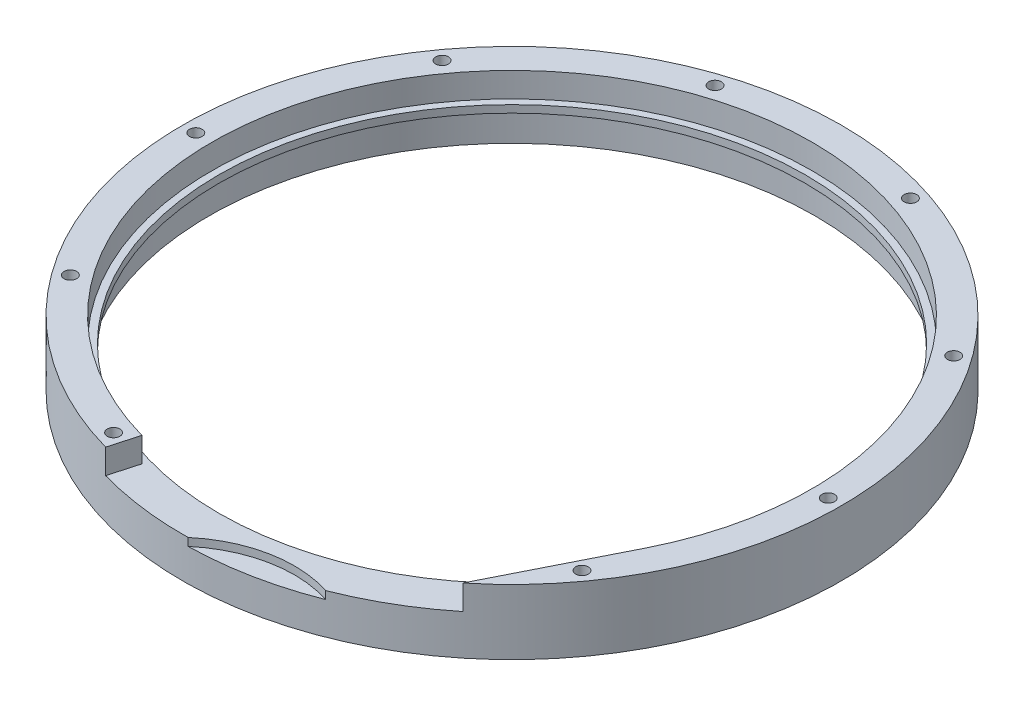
ISO-10303-21;
HEADER;
FILE_DESCRIPTION(('STEP AP214'),'2;1');
FILE_NAME('part.step','',(''),(''),'','','');
FILE_SCHEMA(('AUTOMOTIVE_DESIGN { 1 0 10303 214 1 1 1 1 }'));
ENDSEC;
DATA;
#1=APPLICATION_CONTEXT('core data for automotive mechanical design processes');
#2=APPLICATION_PROTOCOL_DEFINITION('international standard','automotive_design',2000,#1);
#3=PRODUCT_CONTEXT('',#1,'mechanical');
#4=PRODUCT('Part','Part','',(#3));
#5=PRODUCT_RELATED_PRODUCT_CATEGORY('part','',(#4));
#6=PRODUCT_DEFINITION_FORMATION('','',#4);
#7=PRODUCT_DEFINITION_CONTEXT('part definition',#1,'design');
#8=PRODUCT_DEFINITION('design','',#6,#7);
#9=PRODUCT_DEFINITION_SHAPE('','',#8);
#10=(LENGTH_UNIT() NAMED_UNIT(*) SI_UNIT(.MILLI.,.METRE.));
#11=(NAMED_UNIT(*) PLANE_ANGLE_UNIT() SI_UNIT($,.RADIAN.));
#12=(NAMED_UNIT(*) SI_UNIT($,.STERADIAN.) SOLID_ANGLE_UNIT());
#13=UNCERTAINTY_MEASURE_WITH_UNIT(LENGTH_MEASURE(1.E-05),#10,'distance_accuracy_value','');
#14=(GEOMETRIC_REPRESENTATION_CONTEXT(3) GLOBAL_UNCERTAINTY_ASSIGNED_CONTEXT((#13)) GLOBAL_UNIT_ASSIGNED_CONTEXT((#10,
#11,#12)) REPRESENTATION_CONTEXT('',''));
#15=CARTESIAN_POINT('',(0.,0.,0.));
#16=DIRECTION('',(0.,0.,1.));
#17=DIRECTION('',(1.,0.,0.));
#18=AXIS2_PLACEMENT_3D('',#15,#16,#17);
#19=CARTESIAN_POINT('',(-4.85722573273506E-13,8.88178419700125E-13,2.42861286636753E-13));
#20=DIRECTION('',(0.,0.999999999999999,0.));
#21=DIRECTION('',(0.,0.,1.));
#22=AXIS2_PLACEMENT_3D('',#19,#20,#21);
#23=CYLINDRICAL_SURFACE('',#22,77.2887999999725);
#24=CARTESIAN_POINT('',(-5.41233724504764E-13,-6.36699996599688,2.0122792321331E-13));
#25=DIRECTION('',(0.,0.999999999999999,0.));
#26=DIRECTION('',(0.,0.,1.));
#27=AXIS2_PLACEMENT_3D('',#24,#25,#26);
#28=CIRCLE('',#27,77.2887999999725);
#29=CARTESIAN_POINT('',(69.0599405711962,-6.36699996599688,34.7027839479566));
#30=VERTEX_POINT('',#29);
#31=CARTESIAN_POINT('',(-20.9143837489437,-6.36699996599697,74.4052898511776));
#32=VERTEX_POINT('',#31);
#33=EDGE_CURVE('E138',#30,#32,#28,.T.);
#34=ORIENTED_EDGE('',*,*,#33,.F.);
#35=DIRECTION('',(0.,0.999999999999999,0.));
#36=VECTOR('',#35,1.);
#37=CARTESIAN_POINT('',(69.0599405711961,-131.542997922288,34.7027839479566));
#38=LINE('',#37,#36);
#39=CARTESIAN_POINT('',(69.0599405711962,8.27463098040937E-13,34.7027839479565));
#40=VERTEX_POINT('',#39);
#41=EDGE_CURVE('E67',#30,#40,#38,.T.);
#42=ORIENTED_EDGE('',*,*,#41,.T.);
#43=CARTESIAN_POINT('',(-4.85722573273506E-13,8.88178419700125E-13,2.42861286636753E-13));
#44=DIRECTION('',(0.,0.999999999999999,0.));
#45=DIRECTION('',(0.,0.,1.));
#46=AXIS2_PLACEMENT_3D('',#43,#44,#45);
#47=CIRCLE('',#46,77.2887999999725);
#48=CARTESIAN_POINT('',(-20.9143837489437,7.99707522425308E-13,74.4052898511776));
#49=VERTEX_POINT('',#48);
#50=EDGE_CURVE('E141',#40,#49,#47,.T.);
#51=ORIENTED_EDGE('',*,*,#50,.T.);
#52=DIRECTION('',(0.,0.999999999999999,0.));
#53=VECTOR('',#52,1.);
#54=CARTESIAN_POINT('',(-20.9143837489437,7.4419637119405E-13,74.4052898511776));
#55=LINE('',#54,#53);
#56=EDGE_CURVE('E130',#32,#49,#55,.T.);
#57=ORIENTED_EDGE('',*,*,#56,.F.);
#58=EDGE_LOOP('',(#34,#42,#51,#57));
#59=FACE_BOUND('',#58,.T.);
#60=ADVANCED_FACE('F44',(#59),#23,.F.);
#61=CARTESIAN_POINT('',(75.4999999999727,8.88178419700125E-13,1.80411241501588E-13));
#62=DIRECTION('',(0.,-0.999999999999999,0.));
#63=DIRECTION('',(0.,0.,-1.));
#64=AXIS2_PLACEMENT_3D('',#61,#62,#63);
#65=PLANE('',#64);
#66=CARTESIAN_POINT('',(65.8774448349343,8.88178419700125E-13,-47.8627653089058));
#67=DIRECTION('',(0.,-0.999999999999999,0.));
#68=DIRECTION('',(0.,0.,-1.));
#69=AXIS2_PLACEMENT_3D('',#66,#67,#68);
#70=CIRCLE('',#69,1.63194999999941);
#71=CARTESIAN_POINT('',(65.8774448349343,8.84708972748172E-13,-49.4947153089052));
#72=VERTEX_POINT('',#71);
#73=EDGE_CURVE('E372',#72,#72,#70,.T.);
#74=ORIENTED_EDGE('',*,*,#73,.T.);
#75=EDGE_LOOP('',(#74));
#76=FACE_BOUND('',#75,.T.);
#77=CARTESIAN_POINT('',(25.1629448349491,9.43689570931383E-13,-77.4435810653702));
#78=DIRECTION('',(0.,-0.999999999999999,0.));
#79=DIRECTION('',(0.,0.,-1.));
#80=AXIS2_PLACEMENT_3D('',#77,#78,#79);
#81=CIRCLE('',#80,1.63194999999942);
#82=CARTESIAN_POINT('',(25.1629448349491,9.40220123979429E-13,-79.0755310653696));
#83=VERTEX_POINT('',#82);
#84=EDGE_CURVE('E376',#83,#83,#81,.T.);
#85=ORIENTED_EDGE('',*,*,#84,.T.);
#86=EDGE_LOOP('',(#85));
#87=FACE_BOUND('',#86,.T.);
#88=CARTESIAN_POINT('',(-25.1629448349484,8.04911692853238E-13,-77.4435810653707));
#89=DIRECTION('',(0.,-0.999999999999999,0.));
#90=DIRECTION('',(0.,0.,-1.));
#91=AXIS2_PLACEMENT_3D('',#88,#89,#90);
#92=CIRCLE('',#91,1.63194999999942);
#93=CARTESIAN_POINT('',(-25.1629448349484,8.01442245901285E-13,-79.0755310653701));
#94=VERTEX_POINT('',#93);
#95=EDGE_CURVE('E385',#94,#94,#92,.T.);
#96=ORIENTED_EDGE('',*,*,#95,.T.);
#97=EDGE_LOOP('',(#96));
#98=FACE_BOUND('',#97,.T.);
#99=CARTESIAN_POINT('',(-65.8774448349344,8.60422844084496E-13,-47.8627653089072));
#100=DIRECTION('',(0.,-0.999999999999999,0.));
#101=DIRECTION('',(0.,0.,-1.));
#102=AXIS2_PLACEMENT_3D('',#99,#100,#101);
#103=CIRCLE('',#102,1.63194999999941);
#104=CARTESIAN_POINT('',(-65.8774448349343,8.56953397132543E-13,-49.4947153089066));
#105=VERTEX_POINT('',#104);
#106=EDGE_CURVE('E391',#105,#105,#103,.T.);
#107=ORIENTED_EDGE('',*,*,#106,.T.);
#108=EDGE_LOOP('',(#107));
#109=FACE_BOUND('',#108,.T.);
#110=CARTESIAN_POINT('',(-81.4289999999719,8.27463098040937E-13,-2.28983498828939E-13));
#111=DIRECTION('',(0.,-0.999999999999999,0.));
#112=DIRECTION('',(0.,0.,-1.));
#113=AXIS2_PLACEMENT_3D('',#110,#111,#112);
#114=CIRCLE('',#113,1.63194999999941);
#115=CARTESIAN_POINT('',(-81.4289999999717,8.29197821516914E-13,-1.6319499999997));
#116=VERTEX_POINT('',#115);
#117=EDGE_CURVE('E397',#116,#116,#114,.T.);
#118=ORIENTED_EDGE('',*,*,#117,.T.);
#119=EDGE_LOOP('',(#118));
#120=FACE_BOUND('',#119,.T.);
#121=CARTESIAN_POINT('',(-65.8774448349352,8.60422844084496E-13,47.8627653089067));
#122=DIRECTION('',(0.,-0.999999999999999,0.));
#123=DIRECTION('',(0.,0.,-1.));
#124=AXIS2_PLACEMENT_3D('',#121,#122,#123);
#125=CIRCLE('',#124,1.63194999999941);
#126=CARTESIAN_POINT('',(-65.8774448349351,8.56953397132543E-13,46.2308153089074));
#127=VERTEX_POINT('',#126);
#128=EDGE_CURVE('E403',#127,#127,#125,.T.);
#129=ORIENTED_EDGE('',*,*,#128,.T.);
#130=EDGE_LOOP('',(#129));
#131=FACE_BOUND('',#130,.T.);
#132=CARTESIAN_POINT('',(-25.1629448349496,7.4419637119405E-13,77.4435810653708));
#133=DIRECTION('',(0.,-0.999999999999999,0.));
#134=DIRECTION('',(0.,0.,-1.));
#135=AXIS2_PLACEMENT_3D('',#132,#133,#134);
#136=CIRCLE('',#135,1.63194999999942);
#137=CARTESIAN_POINT('',(-25.1629448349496,7.45931094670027E-13,75.8116310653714));
#138=VERTEX_POINT('',#137);
#139=EDGE_CURVE('E409',#138,#138,#136,.T.);
#140=ORIENTED_EDGE('',*,*,#139,.T.);
#141=EDGE_LOOP('',(#140));
#142=FACE_BOUND('',#141,.T.);
#143=CARTESIAN_POINT('',(65.8774448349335,9.10729824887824E-13,47.8627653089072));
#144=DIRECTION('',(0.,-0.999999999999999,0.));
#145=DIRECTION('',(0.,0.,-1.));
#146=AXIS2_PLACEMENT_3D('',#143,#144,#145);
#147=CIRCLE('',#146,1.63194999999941);
#148=CARTESIAN_POINT('',(65.8774448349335,9.12464548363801E-13,46.2308153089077));
#149=VERTEX_POINT('',#148);
#150=EDGE_CURVE('E415',#149,#149,#147,.T.);
#151=ORIENTED_EDGE('',*,*,#150,.T.);
#152=EDGE_LOOP('',(#151));
#153=FACE_BOUND('',#152,.T.);
#154=CARTESIAN_POINT('',(81.4289999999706,8.88178419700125E-13,2.0122792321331E-13));
#155=DIRECTION('',(0.,-0.999999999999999,0.));
#156=DIRECTION('',(0.,0.,-1.));
#157=AXIS2_PLACEMENT_3D('',#154,#155,#156);
#158=CIRCLE('',#157,1.63194999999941);
#159=CARTESIAN_POINT('',(81.4289999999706,8.84708972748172E-13,-1.63194999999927));
#160=VERTEX_POINT('',#159);
#161=EDGE_CURVE('E421',#160,#160,#158,.T.);
#162=ORIENTED_EDGE('',*,*,#161,.T.);
#163=EDGE_LOOP('',(#162));
#164=FACE_BOUND('',#163,.T.);
#165=ORIENTED_EDGE('',*,*,#50,.F.);
#166=DIRECTION('',(0.449001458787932,0.,-0.893531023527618));
#167=VECTOR('',#166,1.);
#168=CARTESIAN_POINT('',(53.3300053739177,8.60422844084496E-13,66.0059898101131));
#169=LINE('',#168,#167);
#170=CARTESIAN_POINT('',(53.3300053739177,8.60422844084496E-13,66.0059898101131));
#171=VERTEX_POINT('',#170);
#172=EDGE_CURVE('E113',#171,#40,#169,.T.);
#173=ORIENTED_EDGE('',*,*,#172,.F.);
#174=CARTESIAN_POINT('',(-4.85722573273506E-13,8.88178419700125E-13,2.42861286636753E-13));
#175=DIRECTION('',(0.,0.999999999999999,0.));
#176=DIRECTION('',(0.,0.,1.));
#177=AXIS2_PLACEMENT_3D('',#174,#175,#176);
#178=CIRCLE('',#177,84.8579999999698);
#179=CARTESIAN_POINT('',(-22.9626126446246,7.49400541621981E-13,81.692096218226));
#180=VERTEX_POINT('',#179);
#181=EDGE_CURVE('E52',#171,#180,#178,.T.);
#182=ORIENTED_EDGE('',*,*,#181,.T.);
#183=DIRECTION('',(-0.270600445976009,0.,0.96269174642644));
#184=VECTOR('',#183,1.);
#185=CARTESIAN_POINT('',(-4.85722573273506E-13,8.88178419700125E-13,2.42861286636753E-13));
#186=LINE('',#185,#184);
#187=EDGE_CURVE('E111',#49,#180,#186,.T.);
#188=ORIENTED_EDGE('',*,*,#187,.F.);
#189=EDGE_LOOP('',(#165,#173,#182,#188));
#190=FACE_BOUND('',#189,.T.);
#191=ADVANCED_FACE('F46',(#76,#87,#98,#109,#120,#131,#142,#153,#164,#190),#65,.F.);
#192=CARTESIAN_POINT('',(-4.85722573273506E-13,8.88178419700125E-13,2.42861286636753E-13));
#193=DIRECTION('',(0.,0.999999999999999,0.));
#194=DIRECTION('',(0.,0.,1.));
#195=AXIS2_PLACEMENT_3D('',#192,#193,#194);
#196=CYLINDRICAL_SURFACE('',#195,75.4999999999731);
#197=CARTESIAN_POINT('',(-5.82867087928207E-13,-8.2719999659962,2.22044604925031E-13));
#198=DIRECTION('',(0.,0.999999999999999,0.));
#199=DIRECTION('',(0.,0.,1.));
#200=AXIS2_PLACEMENT_3D('',#197,#198,#199);
#201=CIRCLE('',#200,75.4999999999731);
#202=CARTESIAN_POINT('',(-5.55017587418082E-13,-8.27199996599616,75.4999999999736));
#203=VERTEX_POINT('',#202);
#204=EDGE_CURVE('E147',#203,#203,#201,.T.);
#205=CARTESIAN_POINT('',(-5.41233724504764E-13,-6.36699996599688,2.0122792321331E-13));
#206=DIRECTION('',(0.,0.999999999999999,0.));
#207=DIRECTION('',(0.,0.,1.));
#208=AXIS2_PLACEMENT_3D('',#205,#206,#207);
#209=CIRCLE('',#208,75.4999999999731);
#210=CARTESIAN_POINT('',(-5.53537105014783E-13,-6.36699996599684,75.4999999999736));
#211=VERTEX_POINT('',#210);
#212=EDGE_CURVE('E135',#211,#211,#209,.T.);
#213=CARTESIAN_POINT('',(-5.55017587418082E-13,-8.27199996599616,75.4999999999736));
#214=CARTESIAN_POINT('',(-5.55002165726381E-13,-8.25215621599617,75.4999999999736));
#215=CARTESIAN_POINT('',(-5.5498674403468E-13,-8.23231246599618,75.4999999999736));
#216=CARTESIAN_POINT('',(-5.54955900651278E-13,-8.19262496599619,75.4999999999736));
#217=CARTESIAN_POINT('',(-5.54940478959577E-13,-8.1727812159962,75.4999999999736));
#218=CARTESIAN_POINT('',(-5.54909635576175E-13,-8.13309371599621,75.4999999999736));
#219=CARTESIAN_POINT('',(-5.54894213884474E-13,-8.11324996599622,75.4999999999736));
#220=CARTESIAN_POINT('',(-5.54863370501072E-13,-8.07356246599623,75.4999999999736));
#221=CARTESIAN_POINT('',(-5.54847948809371E-13,-8.05371871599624,75.4999999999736));
#222=CARTESIAN_POINT('',(-5.54817105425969E-13,-8.01403121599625,75.4999999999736));
#223=CARTESIAN_POINT('',(-5.54801683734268E-13,-7.99418746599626,75.4999999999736));
#224=CARTESIAN_POINT('',(-5.54770840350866E-13,-7.95449996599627,75.4999999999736));
#225=CARTESIAN_POINT('',(-5.54755418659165E-13,-7.93465621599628,75.4999999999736));
#226=CARTESIAN_POINT('',(-5.54724575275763E-13,-7.8949687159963,75.4999999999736));
#227=CARTESIAN_POINT('',(-5.54709153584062E-13,-7.8751249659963,75.4999999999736));
#228=CARTESIAN_POINT('',(-5.5467831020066E-13,-7.83543746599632,75.4999999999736));
#229=CARTESIAN_POINT('',(-5.54662888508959E-13,-7.81559371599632,75.4999999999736));
#230=CARTESIAN_POINT('',(-5.54632045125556E-13,-7.77590621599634,75.4999999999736));
#231=CARTESIAN_POINT('',(-5.54616623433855E-13,-7.75606246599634,75.4999999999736));
#232=CARTESIAN_POINT('',(-5.54585780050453E-13,-7.71637496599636,75.4999999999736));
#233=CARTESIAN_POINT('',(-5.54570358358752E-13,-7.69653121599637,75.4999999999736));
#234=CARTESIAN_POINT('',(-5.5453951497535E-13,-7.65684371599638,75.4999999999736));
#235=CARTESIAN_POINT('',(-5.54524093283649E-13,-7.63699996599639,75.4999999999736));
#236=CARTESIAN_POINT('',(-5.54493249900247E-13,-7.5973124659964,75.4999999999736));
#237=CARTESIAN_POINT('',(-5.54477828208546E-13,-7.57746871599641,75.4999999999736));
#238=CARTESIAN_POINT('',(-5.54446984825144E-13,-7.53778121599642,75.4999999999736));
#239=CARTESIAN_POINT('',(-5.54431563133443E-13,-7.51793746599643,75.4999999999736));
#240=CARTESIAN_POINT('',(-5.54400719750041E-13,-7.47824996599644,75.4999999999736));
#241=CARTESIAN_POINT('',(-5.5438529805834E-13,-7.45840621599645,75.4999999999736));
#242=CARTESIAN_POINT('',(-5.54354454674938E-13,-7.41871871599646,75.4999999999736));
#243=CARTESIAN_POINT('',(-5.54339032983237E-13,-7.39887496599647,75.4999999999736));
#244=CARTESIAN_POINT('',(-5.54308189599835E-13,-7.35918746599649,75.4999999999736));
#245=CARTESIAN_POINT('',(-5.54292767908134E-13,-7.33934371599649,75.4999999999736));
#246=CARTESIAN_POINT('',(-5.54261924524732E-13,-7.29965621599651,75.4999999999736));
#247=CARTESIAN_POINT('',(-5.54246502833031E-13,-7.27981246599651,75.4999999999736));
#248=CARTESIAN_POINT('',(-5.54215659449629E-13,-7.24012496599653,75.4999999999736));
#249=CARTESIAN_POINT('',(-5.54200237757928E-13,-7.22028121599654,75.4999999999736));
#250=CARTESIAN_POINT('',(-5.54169394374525E-13,-7.18059371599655,75.4999999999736));
#251=CARTESIAN_POINT('',(-5.54153972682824E-13,-7.16074996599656,75.4999999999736));
#252=CARTESIAN_POINT('',(-5.54123129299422E-13,-7.12106246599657,75.4999999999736));
#253=CARTESIAN_POINT('',(-5.54107707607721E-13,-7.10121871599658,75.4999999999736));
#254=CARTESIAN_POINT('',(-5.54076864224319E-13,-7.06153121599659,75.4999999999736));
#255=CARTESIAN_POINT('',(-5.54061442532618E-13,-7.0416874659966,75.4999999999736));
#256=CARTESIAN_POINT('',(-5.54030599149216E-13,-7.00199996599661,75.4999999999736));
#257=CARTESIAN_POINT('',(-5.54015177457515E-13,-6.98215621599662,75.4999999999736));
#258=CARTESIAN_POINT('',(-5.53984334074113E-13,-6.94246871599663,75.4999999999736));
#259=CARTESIAN_POINT('',(-5.53968912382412E-13,-6.92262496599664,75.4999999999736));
#260=CARTESIAN_POINT('',(-5.5393806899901E-13,-6.88293746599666,75.4999999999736));
#261=CARTESIAN_POINT('',(-5.53922647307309E-13,-6.86309371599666,75.4999999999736));
#262=CARTESIAN_POINT('',(-5.53891803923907E-13,-6.82340621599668,75.4999999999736));
#263=CARTESIAN_POINT('',(-5.53876382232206E-13,-6.80356246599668,75.4999999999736));
#264=CARTESIAN_POINT('',(-5.53845538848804E-13,-6.7638749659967,75.4999999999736));
#265=CARTESIAN_POINT('',(-5.53830117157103E-13,-6.7440312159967,75.4999999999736));
#266=CARTESIAN_POINT('',(-5.53799273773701E-13,-6.70434371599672,75.4999999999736));
#267=CARTESIAN_POINT('',(-5.53783852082E-13,-6.68449996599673,75.4999999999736));
#268=CARTESIAN_POINT('',(-5.53753008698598E-13,-6.64481246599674,75.4999999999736));
#269=CARTESIAN_POINT('',(-5.53737587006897E-13,-6.62496871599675,75.4999999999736));
#270=CARTESIAN_POINT('',(-5.53706743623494E-13,-6.58528121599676,75.4999999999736));
#271=CARTESIAN_POINT('',(-5.53691321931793E-13,-6.56543746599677,75.4999999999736));
#272=CARTESIAN_POINT('',(-5.53660478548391E-13,-6.52574996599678,75.4999999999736));
#273=CARTESIAN_POINT('',(-5.5364505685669E-13,-6.50590621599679,75.4999999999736));
#274=CARTESIAN_POINT('',(-5.53614213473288E-13,-6.4662187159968,75.4999999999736));
#275=CARTESIAN_POINT('',(-5.53598791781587E-13,-6.44637496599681,75.4999999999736));
#276=CARTESIAN_POINT('',(-5.53567948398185E-13,-6.40668746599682,75.4999999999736));
#277=CARTESIAN_POINT('',(-5.53552526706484E-13,-6.38684371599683,75.4999999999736));
#278=CARTESIAN_POINT('',(-5.53537105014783E-13,-6.36699996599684,75.4999999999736));
#279=B_SPLINE_CURVE_WITH_KNOTS('',3,(#213,#214,#215,#216,#217,#218,#219,#220,#221,#222,#223,
#224,#225,#226,#227,#228,#229,#230,#231,#232,#233,#234,#235,#236,#237,#238,#239,#240,#241,#242,
#243,#244,#245,#246,#247,#248,#249,#250,#251,#252,#253,#254,#255,#256,#257,#258,#259,#260,#261,
#262,#263,#264,#265,#266,#267,#268,#269,#270,#271,#272,#273,#274,#275,#276,#277,#278),
.UNSPECIFIED.,.F.,.F.,(4,2,2,2,2,2,2,2,2,2,2,2,2,2,2,2,2,2,2,2,2,2,2,2,2,2,2,2,2,2,2,2,4),(0.,
0.0595312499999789,0.119062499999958,0.178593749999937,0.238124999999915,0.297656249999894,
0.357187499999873,0.416718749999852,0.476249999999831,0.53578124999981,0.595312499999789,
0.654843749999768,0.714374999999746,0.773906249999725,0.833437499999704,0.892968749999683,
0.952499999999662,1.01203124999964,1.07156249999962,1.1310937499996,1.19062499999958,
1.25015624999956,1.30968749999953,1.36921874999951,1.42874999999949,1.48828124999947,
1.54781249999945,1.60734374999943,1.66687499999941,1.72640624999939,1.78593749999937,
1.84546874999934,1.90499999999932),.UNSPECIFIED.);
#280=EDGE_CURVE('BSEAM174',#203,#211,#279,.T.);
#281=ORIENTED_EDGE('',*,*,#204,.F.);
#282=ORIENTED_EDGE('',*,*,#212,.T.);
#283=ORIENTED_EDGE('',*,*,#280,.T.);
#284=ORIENTED_EDGE('',*,*,#280,.F.);
#285=EDGE_LOOP('',(#281,#283,#282,#284));
#286=FACE_BOUND('',#285,.T.);
#287=ADVANCED_FACE('F174',(#286),#196,.F.);
#288=CARTESIAN_POINT('',(-4.85722573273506E-13,8.88178419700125E-13,2.42861286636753E-13));
#289=DIRECTION('',(0.,0.999999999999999,0.));
#290=DIRECTION('',(0.,0.,1.));
#291=AXIS2_PLACEMENT_3D('',#288,#289,#290);
#292=CYLINDRICAL_SURFACE('',#291,84.8579999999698);
#293=CARTESIAN_POINT('',(-5.41233724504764E-13,-6.36699996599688,2.0122792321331E-13));
#294=DIRECTION('',(0.,0.999999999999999,0.));
#295=DIRECTION('',(0.,0.,1.));
#296=AXIS2_PLACEMENT_3D('',#293,#294,#295);
#297=CIRCLE('',#296,84.8579999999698);
#298=CARTESIAN_POINT('',(53.3300053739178,-6.36699996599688,66.0059898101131));
#299=VERTEX_POINT('',#298);
#300=CARTESIAN_POINT('',(30.9990199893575,-6.36699996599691,78.9932967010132));
#301=VERTEX_POINT('',#300);
#302=EDGE_CURVE('E110',#299,#301,#297,.F.);
#303=ORIENTED_EDGE('',*,*,#302,.T.);
#304=DIRECTION('',(0.,0.999999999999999,0.));
#305=VECTOR('',#304,1.);
#306=CARTESIAN_POINT('',(30.9990199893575,-7.36699996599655,78.9932967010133));
#307=LINE('',#306,#305);
#308=CARTESIAN_POINT('',(30.9990199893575,-8.36699996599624,78.9932967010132));
#309=VERTEX_POINT('',#308);
#310=EDGE_CURVE('E59',#301,#309,#307,.F.);
#311=ORIENTED_EDGE('',*,*,#310,.T.);
#312=CARTESIAN_POINT('',(-5.68989300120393E-13,-8.36699996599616,2.28983498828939E-13));
#313=DIRECTION('',(0.,0.999999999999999,0.));
#314=DIRECTION('',(0.,0.,1.));
#315=AXIS2_PLACEMENT_3D('',#312,#313,#314);
#316=CIRCLE('',#315,84.8579999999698);
#317=CARTESIAN_POINT('',(1.4522555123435,-8.36699996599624,84.8455721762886));
#318=VERTEX_POINT('',#317);
#319=EDGE_CURVE('E13',#318,#309,#316,.T.);
#320=ORIENTED_EDGE('',*,*,#319,.F.);
#321=DIRECTION('',(0.,0.999999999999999,0.));
#322=VECTOR('',#321,1.);
#323=CARTESIAN_POINT('',(1.45225551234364,-7.3669999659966,84.8455721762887));
#324=LINE('',#323,#322);
#325=CARTESIAN_POINT('',(1.45225551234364,-6.3669999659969,84.8455721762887));
#326=VERTEX_POINT('',#325);
#327=EDGE_CURVE('E102',#318,#326,#324,.T.);
#328=ORIENTED_EDGE('',*,*,#327,.T.);
#329=CARTESIAN_POINT('',(-22.9626126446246,-6.36699996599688,81.692096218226));
#330=VERTEX_POINT('',#329);
#331=EDGE_CURVE('E119',#326,#330,#297,.F.);
#332=ORIENTED_EDGE('',*,*,#331,.T.);
#333=DIRECTION('',(0.,0.999999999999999,0.));
#334=VECTOR('',#333,1.);
#335=CARTESIAN_POINT('',(-22.9626126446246,-131.542997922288,81.692096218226));
#336=LINE('',#335,#334);
#337=EDGE_CURVE('E123',#330,#180,#336,.T.);
#338=ORIENTED_EDGE('',*,*,#337,.T.);
#339=ORIENTED_EDGE('',*,*,#181,.F.);
#340=DIRECTION('',(0.,0.999999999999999,0.));
#341=VECTOR('',#340,1.);
#342=CARTESIAN_POINT('',(53.3300053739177,-131.542997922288,66.0059898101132));
#343=LINE('',#342,#341);
#344=EDGE_CURVE('E125',#299,#171,#343,.T.);
#345=ORIENTED_EDGE('',*,*,#344,.F.);
#346=EDGE_LOOP('',(#303,#311,#320,#328,#332,#338,#339,#345));
#347=FACE_BOUND('',#346,.T.);
#348=CARTESIAN_POINT('',(-5.41233724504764E-13,-16.7719999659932,2.15105711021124E-13));
#349=DIRECTION('',(0.,-0.999999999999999,0.));
#350=DIRECTION('',(0.,0.,-1.));
#351=AXIS2_PLACEMENT_3D('',#348,#349,#350);
#352=CIRCLE('',#351,84.8579999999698);
#353=CARTESIAN_POINT('',(-4.70575245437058E-13,-16.7719999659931,-84.8579999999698));
#354=VERTEX_POINT('',#353);
#355=EDGE_CURVE('E144',#354,#354,#352,.T.);
#356=ORIENTED_EDGE('',*,*,#355,.F.);
#357=EDGE_LOOP('',(#356));
#358=FACE_BOUND('',#357,.T.);
#359=ADVANCED_FACE('F106',(#347,#358),#292,.T.);
#360=CARTESIAN_POINT('',(-4.85722573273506E-13,8.88178419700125E-13,2.42861286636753E-13));
#361=DIRECTION('',(0.,0.999999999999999,0.));
#362=DIRECTION('',(0.,0.,1.));
#363=AXIS2_PLACEMENT_3D('',#360,#361,#362);
#364=CYLINDRICAL_SURFACE('',#363,77.9999999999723);
#365=CARTESIAN_POINT('',(-5.82867087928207E-13,-8.2719999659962,2.22044604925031E-13));
#366=DIRECTION('',(0.,0.999999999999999,0.));
#367=DIRECTION('',(0.,0.,1.));
#368=AXIS2_PLACEMENT_3D('',#365,#366,#367);
#369=CIRCLE('',#368,77.9999999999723);
#370=CARTESIAN_POINT('',(-5.57099255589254E-13,-8.27199996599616,77.9999999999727));
#371=VERTEX_POINT('',#370);
#372=EDGE_CURVE('E150',#371,#371,#369,.T.);
#373=CARTESIAN_POINT('',(-5.41233724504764E-13,-16.7719999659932,2.15105711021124E-13));
#374=DIRECTION('',(0.,-0.999999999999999,0.));
#375=DIRECTION('',(0.,0.,-1.));
#376=AXIS2_PLACEMENT_3D('',#373,#374,#375);
#377=CIRCLE('',#376,77.9999999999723);
#378=CARTESIAN_POINT('',(-5.63705082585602E-13,-16.7719999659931,77.9999999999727));
#379=VERTEX_POINT('',#378);
#380=EDGE_CURVE('E132',#379,#379,#377,.T.);
#381=CARTESIAN_POINT('',(-5.57099255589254E-13,-8.27199996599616,77.9999999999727));
#382=CARTESIAN_POINT('',(-5.57168066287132E-13,-8.3605416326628,77.9999999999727));
#383=CARTESIAN_POINT('',(-5.57236876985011E-13,-8.44908329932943,77.9999999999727));
#384=CARTESIAN_POINT('',(-5.57374498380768E-13,-8.6261666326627,77.9999999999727));
#385=CARTESIAN_POINT('',(-5.57443309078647E-13,-8.71470829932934,77.9999999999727));
#386=CARTESIAN_POINT('',(-5.57580930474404E-13,-8.89179163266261,77.9999999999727));
#387=CARTESIAN_POINT('',(-5.57649741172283E-13,-8.98033329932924,77.9999999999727));
#388=CARTESIAN_POINT('',(-5.5778736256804E-13,-9.15741663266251,77.9999999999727));
#389=CARTESIAN_POINT('',(-5.57856173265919E-13,-9.24595829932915,77.9999999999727));
#390=CARTESIAN_POINT('',(-5.57993794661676E-13,-9.42304163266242,77.9999999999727));
#391=CARTESIAN_POINT('',(-5.58062605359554E-13,-9.51158329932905,77.9999999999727));
#392=CARTESIAN_POINT('',(-5.58200226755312E-13,-9.68866663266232,77.9999999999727));
#393=CARTESIAN_POINT('',(-5.5826903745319E-13,-9.77720829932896,77.9999999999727));
#394=CARTESIAN_POINT('',(-5.58406658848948E-13,-9.95429163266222,77.9999999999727));
#395=CARTESIAN_POINT('',(-5.58475469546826E-13,-10.0428332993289,77.9999999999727));
#396=CARTESIAN_POINT('',(-5.58613090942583E-13,-10.2199166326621,77.9999999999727));
#397=CARTESIAN_POINT('',(-5.58681901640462E-13,-10.3084582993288,77.9999999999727));
#398=CARTESIAN_POINT('',(-5.58819523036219E-13,-10.485541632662,77.9999999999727));
#399=CARTESIAN_POINT('',(-5.58888333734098E-13,-10.5740832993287,77.9999999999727));
#400=CARTESIAN_POINT('',(-5.59025955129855E-13,-10.7511666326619,77.9999999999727));
#401=CARTESIAN_POINT('',(-5.59094765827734E-13,-10.8397082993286,77.9999999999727));
#402=CARTESIAN_POINT('',(-5.59232387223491E-13,-11.0167916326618,77.9999999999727));
#403=CARTESIAN_POINT('',(-5.5930119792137E-13,-11.1053332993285,77.9999999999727));
#404=CARTESIAN_POINT('',(-5.59438819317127E-13,-11.2824166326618,77.9999999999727));
#405=CARTESIAN_POINT('',(-5.59507630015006E-13,-11.3709582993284,77.9999999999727));
#406=CARTESIAN_POINT('',(-5.59645251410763E-13,-11.5480416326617,77.9999999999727));
#407=CARTESIAN_POINT('',(-5.59714062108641E-13,-11.6365832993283,77.9999999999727));
#408=CARTESIAN_POINT('',(-5.59851683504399E-13,-11.8136666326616,77.9999999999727));
#409=CARTESIAN_POINT('',(-5.59920494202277E-13,-11.9022082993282,77.9999999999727));
#410=CARTESIAN_POINT('',(-5.60058115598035E-13,-12.0792916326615,77.9999999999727));
#411=CARTESIAN_POINT('',(-5.60126926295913E-13,-12.1678332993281,77.9999999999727));
#412=CARTESIAN_POINT('',(-5.6026454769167E-13,-12.3449166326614,77.9999999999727));
#413=CARTESIAN_POINT('',(-5.60333358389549E-13,-12.433458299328,77.9999999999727));
#414=CARTESIAN_POINT('',(-5.60470979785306E-13,-12.6105416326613,77.9999999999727));
#415=CARTESIAN_POINT('',(-5.60539790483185E-13,-12.6990832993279,77.9999999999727));
#416=CARTESIAN_POINT('',(-5.60677411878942E-13,-12.8761666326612,77.9999999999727));
#417=CARTESIAN_POINT('',(-5.60746222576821E-13,-12.9647082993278,77.9999999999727));
#418=CARTESIAN_POINT('',(-5.60883843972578E-13,-13.1417916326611,77.9999999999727));
#419=CARTESIAN_POINT('',(-5.60952654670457E-13,-13.2303332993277,77.9999999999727));
#420=CARTESIAN_POINT('',(-5.61090276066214E-13,-13.407416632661,77.9999999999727));
#421=CARTESIAN_POINT('',(-5.61159086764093E-13,-13.4959582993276,77.9999999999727));
#422=CARTESIAN_POINT('',(-5.6129670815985E-13,-13.6730416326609,77.9999999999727));
#423=CARTESIAN_POINT('',(-5.61365518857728E-13,-13.7615832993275,77.9999999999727));
#424=CARTESIAN_POINT('',(-5.61503140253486E-13,-13.9386666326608,77.9999999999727));
#425=CARTESIAN_POINT('',(-5.61571950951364E-13,-14.0272082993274,77.9999999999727));
#426=CARTESIAN_POINT('',(-5.61709572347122E-13,-14.2042916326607,77.9999999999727));
#427=CARTESIAN_POINT('',(-5.61778383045E-13,-14.2928332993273,77.9999999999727));
#428=CARTESIAN_POINT('',(-5.61916004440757E-13,-14.4699166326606,77.9999999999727));
#429=CARTESIAN_POINT('',(-5.61984815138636E-13,-14.5584582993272,77.9999999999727));
#430=CARTESIAN_POINT('',(-5.62122436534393E-13,-14.7355416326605,77.9999999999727));
#431=CARTESIAN_POINT('',(-5.62191247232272E-13,-14.8240832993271,77.9999999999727));
#432=CARTESIAN_POINT('',(-5.62328868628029E-13,-15.0011666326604,77.9999999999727));
#433=CARTESIAN_POINT('',(-5.62397679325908E-13,-15.0897082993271,77.9999999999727));
#434=CARTESIAN_POINT('',(-5.62535300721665E-13,-15.2667916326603,77.9999999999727));
#435=CARTESIAN_POINT('',(-5.62604111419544E-13,-15.355333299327,77.9999999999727));
#436=CARTESIAN_POINT('',(-5.62741732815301E-13,-15.5324166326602,77.9999999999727));
#437=CARTESIAN_POINT('',(-5.6281054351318E-13,-15.6209582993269,77.9999999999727));
#438=CARTESIAN_POINT('',(-5.62948164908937E-13,-15.7980416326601,77.9999999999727));
#439=CARTESIAN_POINT('',(-5.63016975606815E-13,-15.8865832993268,77.9999999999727));
#440=CARTESIAN_POINT('',(-5.63154597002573E-13,-16.06366663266,77.9999999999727));
#441=CARTESIAN_POINT('',(-5.63223407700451E-13,-16.1522082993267,77.9999999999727));
#442=CARTESIAN_POINT('',(-5.63361029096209E-13,-16.3292916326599,77.9999999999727));
#443=CARTESIAN_POINT('',(-5.63429839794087E-13,-16.4178332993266,77.9999999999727));
#444=CARTESIAN_POINT('',(-5.63567461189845E-13,-16.5949166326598,77.9999999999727));
#445=CARTESIAN_POINT('',(-5.63636271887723E-13,-16.6834582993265,77.9999999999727));
#446=CARTESIAN_POINT('',(-5.63705082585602E-13,-16.7719999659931,77.9999999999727));
#447=B_SPLINE_CURVE_WITH_KNOTS('',3,(#381,#382,#383,#384,#385,#386,#387,#388,#389,#390,#391,
#392,#393,#394,#395,#396,#397,#398,#399,#400,#401,#402,#403,#404,#405,#406,#407,#408,#409,#410,
#411,#412,#413,#414,#415,#416,#417,#418,#419,#420,#421,#422,#423,#424,#425,#426,#427,#428,#429,
#430,#431,#432,#433,#434,#435,#436,#437,#438,#439,#440,#441,#442,#443,#444,#445,#446),
.UNSPECIFIED.,.F.,.F.,(4,2,2,2,2,2,2,2,2,2,2,2,2,2,2,2,2,2,2,2,2,2,2,2,2,2,2,2,2,2,2,2,4),(0.,
0.265624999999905,0.53124999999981,0.796874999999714,1.06249999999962,1.32812499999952,
1.59374999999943,1.85937499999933,2.12499999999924,2.39062499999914,2.65624999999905,
2.92187499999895,3.18749999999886,3.45312499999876,3.71874999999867,3.98437499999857,
4.24999999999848,4.51562499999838,4.78124999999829,5.04687499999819,5.3124999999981,
5.578124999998,5.84374999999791,6.10937499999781,6.37499999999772,6.64062499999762,
6.90624999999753,7.17187499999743,7.43749999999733,7.70312499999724,7.96874999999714,
8.23437499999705,8.49999999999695),.UNSPECIFIED.);
#448=EDGE_CURVE('BSEAM189',#371,#379,#447,.T.);
#449=ORIENTED_EDGE('',*,*,#372,.T.);
#450=ORIENTED_EDGE('',*,*,#380,.T.);
#451=ORIENTED_EDGE('',*,*,#448,.T.);
#452=ORIENTED_EDGE('',*,*,#448,.F.);
#453=EDGE_LOOP('',(#449,#451,#450,#452));
#454=FACE_BOUND('',#453,.T.);
#455=ADVANCED_FACE('F189',(#454),#364,.F.);
#456=CARTESIAN_POINT('',(77.9999999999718,-8.27199996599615,1.59594559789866E-13));
#457=DIRECTION('',(0.,0.999999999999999,0.));
#458=DIRECTION('',(0.,0.,1.));
#459=AXIS2_PLACEMENT_3D('',#456,#457,#458);
#460=PLANE('',#459);
#461=ORIENTED_EDGE('',*,*,#372,.F.);
#462=EDGE_LOOP('',(#461));
#463=FACE_BOUND('',#462,.T.);
#464=ORIENTED_EDGE('',*,*,#204,.T.);
#465=EDGE_LOOP('',(#464));
#466=FACE_BOUND('',#465,.T.);
#467=ADVANCED_FACE('F182',(#463,#466),#460,.F.);
#468=CARTESIAN_POINT('',(-5.41233724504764E-13,-16.7719999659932,2.15105711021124E-13));
#469=DIRECTION('',(0.,-0.999999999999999,0.));
#470=DIRECTION('',(0.,0.,-1.));
#471=AXIS2_PLACEMENT_3D('',#468,#469,#470);
#472=PLANE('',#471);
#473=CARTESIAN_POINT('',(65.8774448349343,-16.7719999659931,-47.8627653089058));
#474=DIRECTION('',(0.,-0.999999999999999,0.));
#475=DIRECTION('',(0.,0.,-1.));
#476=AXIS2_PLACEMENT_3D('',#473,#474,#475);
#477=CIRCLE('',#476,1.63194999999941);
#478=CARTESIAN_POINT('',(65.8774448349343,-16.7719999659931,-49.4947153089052));
#479=VERTEX_POINT('',#478);
#480=EDGE_CURVE('E375',#479,#479,#477,.T.);
#481=ORIENTED_EDGE('',*,*,#480,.F.);
#482=EDGE_LOOP('',(#481));
#483=FACE_BOUND('',#482,.T.);
#484=CARTESIAN_POINT('',(25.1629448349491,-16.7719999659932,-77.4435810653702));
#485=DIRECTION('',(0.,-0.999999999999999,0.));
#486=DIRECTION('',(0.,0.,-1.));
#487=AXIS2_PLACEMENT_3D('',#484,#485,#486);
#488=CIRCLE('',#487,1.63194999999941);
#489=CARTESIAN_POINT('',(25.1629448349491,-16.7719999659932,-79.0755310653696));
#490=VERTEX_POINT('',#489);
#491=EDGE_CURVE('E379',#490,#490,#488,.T.);
#492=ORIENTED_EDGE('',*,*,#491,.F.);
#493=EDGE_LOOP('',(#492));
#494=FACE_BOUND('',#493,.T.);
#495=CARTESIAN_POINT('',(-25.1629448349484,-16.7719999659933,-77.4435810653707));
#496=DIRECTION('',(0.,-0.999999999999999,0.));
#497=DIRECTION('',(0.,0.,-1.));
#498=AXIS2_PLACEMENT_3D('',#495,#496,#497);
#499=CIRCLE('',#498,1.63194999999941);
#500=CARTESIAN_POINT('',(-25.1629448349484,-16.7719999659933,-79.0755310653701));
#501=VERTEX_POINT('',#500);
#502=EDGE_CURVE('E388',#501,#501,#499,.T.);
#503=ORIENTED_EDGE('',*,*,#502,.F.);
#504=EDGE_LOOP('',(#503));
#505=FACE_BOUND('',#504,.T.);
#506=CARTESIAN_POINT('',(-65.8774448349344,-16.7719999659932,-47.8627653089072));
#507=DIRECTION('',(0.,-0.999999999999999,0.));
#508=DIRECTION('',(0.,0.,-1.));
#509=AXIS2_PLACEMENT_3D('',#506,#507,#508);
#510=CIRCLE('',#509,1.63194999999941);
#511=CARTESIAN_POINT('',(-65.8774448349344,-16.7719999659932,-49.4947153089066));
#512=VERTEX_POINT('',#511);
#513=EDGE_CURVE('E394',#512,#512,#510,.T.);
#514=ORIENTED_EDGE('',*,*,#513,.F.);
#515=EDGE_LOOP('',(#514));
#516=FACE_BOUND('',#515,.T.);
#517=CARTESIAN_POINT('',(-81.4289999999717,-16.7719999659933,-2.70616862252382E-13));
#518=DIRECTION('',(0.,-0.999999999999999,0.));
#519=DIRECTION('',(0.,0.,-1.));
#520=AXIS2_PLACEMENT_3D('',#517,#518,#519);
#521=CIRCLE('',#520,1.63194999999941);
#522=CARTESIAN_POINT('',(-81.4289999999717,-16.7719999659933,-1.63194999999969));
#523=VERTEX_POINT('',#522);
#524=EDGE_CURVE('E400',#523,#523,#521,.T.);
#525=ORIENTED_EDGE('',*,*,#524,.F.);
#526=EDGE_LOOP('',(#525));
#527=FACE_BOUND('',#526,.T.);
#528=CARTESIAN_POINT('',(-65.8774448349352,-16.7719999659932,47.8627653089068));
#529=DIRECTION('',(0.,-0.999999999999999,0.));
#530=DIRECTION('',(0.,0.,-1.));
#531=AXIS2_PLACEMENT_3D('',#528,#529,#530);
#532=CIRCLE('',#531,1.63194999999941);
#533=CARTESIAN_POINT('',(-65.8774448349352,-16.7719999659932,46.2308153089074));
#534=VERTEX_POINT('',#533);
#535=EDGE_CURVE('E406',#534,#534,#532,.T.);
#536=ORIENTED_EDGE('',*,*,#535,.F.);
#537=EDGE_LOOP('',(#536));
#538=FACE_BOUND('',#537,.T.);
#539=CARTESIAN_POINT('',(-25.1629448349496,-16.7719999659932,77.4435810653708));
#540=DIRECTION('',(0.,-0.999999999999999,0.));
#541=DIRECTION('',(0.,0.,-1.));
#542=AXIS2_PLACEMENT_3D('',#539,#540,#541);
#543=CIRCLE('',#542,1.63194999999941);
#544=CARTESIAN_POINT('',(-25.1629448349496,-16.7719999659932,75.8116310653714));
#545=VERTEX_POINT('',#544);
#546=EDGE_CURVE('E412',#545,#545,#543,.T.);
#547=ORIENTED_EDGE('',*,*,#546,.F.);
#548=EDGE_LOOP('',(#547));
#549=FACE_BOUND('',#548,.T.);
#550=CARTESIAN_POINT('',(65.8774448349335,-16.7719999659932,47.8627653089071));
#551=DIRECTION('',(0.,-0.999999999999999,0.));
#552=DIRECTION('',(0.,0.,-1.));
#553=AXIS2_PLACEMENT_3D('',#550,#551,#552);
#554=CIRCLE('',#553,1.63194999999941);
#555=CARTESIAN_POINT('',(65.8774448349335,-16.7719999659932,46.2308153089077));
#556=VERTEX_POINT('',#555);
#557=EDGE_CURVE('E418',#556,#556,#554,.T.);
#558=ORIENTED_EDGE('',*,*,#557,.F.);
#559=EDGE_LOOP('',(#558));
#560=FACE_BOUND('',#559,.T.);
#561=CARTESIAN_POINT('',(81.4289999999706,-16.7719999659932,1.59594559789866E-13));
#562=DIRECTION('',(0.,-0.999999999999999,0.));
#563=DIRECTION('',(0.,0.,-1.));
#564=AXIS2_PLACEMENT_3D('',#561,#562,#563);
#565=CIRCLE('',#564,1.63194999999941);
#566=CARTESIAN_POINT('',(81.4289999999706,-16.7719999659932,-1.63194999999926));
#567=VERTEX_POINT('',#566);
#568=EDGE_CURVE('E424',#567,#567,#565,.T.);
#569=ORIENTED_EDGE('',*,*,#568,.F.);
#570=EDGE_LOOP('',(#569));
#571=FACE_BOUND('',#570,.T.);
#572=ORIENTED_EDGE('',*,*,#380,.F.);
#573=EDGE_LOOP('',(#572));
#574=FACE_BOUND('',#573,.T.);
#575=ORIENTED_EDGE('',*,*,#355,.T.);
#576=EDGE_LOOP('',(#575));
#577=FACE_BOUND('',#576,.T.);
#578=ADVANCED_FACE('F179',(#483,#494,#505,#516,#527,#538,#549,#560,#571,#574,#577),#472,.T.);
#579=CARTESIAN_POINT('',(75.4999999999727,-6.36699996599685,1.66533453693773E-13));
#580=DIRECTION('',(0.,0.999999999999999,0.));
#581=DIRECTION('',(0.,0.,1.));
#582=AXIS2_PLACEMENT_3D('',#579,#580,#581);
#583=PLANE('',#582);
#584=CARTESIAN_POINT('',(21.469456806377,-6.36699996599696,108.394245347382));
#585=DIRECTION('',(0.,0.999999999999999,0.));
#586=DIRECTION('',(0.,0.,1.));
#587=AXIS2_PLACEMENT_3D('',#584,#585,#586);
#588=CIRCLE('',#587,30.9067687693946);
#589=EDGE_CURVE('E103',#301,#326,#588,.T.);
#590=ORIENTED_EDGE('',*,*,#589,.F.);
#591=ORIENTED_EDGE('',*,*,#302,.F.);
#592=DIRECTION('',(-0.449001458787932,0.,0.893531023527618));
#593=VECTOR('',#592,1.);
#594=CARTESIAN_POINT('',(53.3300053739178,-6.36699996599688,66.0059898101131));
#595=LINE('',#594,#593);
#596=EDGE_CURVE('E118',#30,#299,#595,.T.);
#597=ORIENTED_EDGE('',*,*,#596,.F.);
#598=ORIENTED_EDGE('',*,*,#33,.T.);
#599=DIRECTION('',(0.270600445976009,0.,-0.96269174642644));
#600=VECTOR('',#599,1.);
#601=CARTESIAN_POINT('',(-5.41233724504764E-13,-6.36699996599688,2.0122792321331E-13));
#602=LINE('',#601,#600);
#603=EDGE_CURVE('E120',#330,#32,#602,.T.);
#604=ORIENTED_EDGE('',*,*,#603,.F.);
#605=ORIENTED_EDGE('',*,*,#331,.F.);
#606=EDGE_LOOP('',(#590,#591,#597,#598,#604,#605));
#607=FACE_BOUND('',#606,.T.);
#608=ORIENTED_EDGE('',*,*,#212,.F.);
#609=EDGE_LOOP('',(#608));
#610=FACE_BOUND('',#609,.T.);
#611=ADVANCED_FACE('F165',(#607,#610),#583,.T.);
#612=CARTESIAN_POINT('',(53.3300053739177,-131.542997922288,66.0059898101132));
#613=DIRECTION('',(0.893531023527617,0.,0.449001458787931));
#614=DIRECTION('',(0.449001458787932,0.,-0.893531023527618));
#615=AXIS2_PLACEMENT_3D('',#612,#613,#614);
#616=PLANE('',#615);
#617=ORIENTED_EDGE('',*,*,#596,.T.);
#618=ORIENTED_EDGE('',*,*,#344,.T.);
#619=ORIENTED_EDGE('',*,*,#172,.T.);
#620=ORIENTED_EDGE('',*,*,#41,.F.);
#621=EDGE_LOOP('',(#617,#618,#619,#620));
#622=FACE_BOUND('',#621,.T.);
#623=ADVANCED_FACE('F216',(#622),#616,.F.);
#624=CARTESIAN_POINT('',(-7.07767178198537E-13,-131.542997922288,2.42861286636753E-13));
#625=DIRECTION('',(-0.96269174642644,0.,-0.270600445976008));
#626=DIRECTION('',(-0.270600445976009,0.,0.96269174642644));
#627=AXIS2_PLACEMENT_3D('',#624,#625,#626);
#628=PLANE('',#627);
#629=ORIENTED_EDGE('',*,*,#56,.T.);
#630=ORIENTED_EDGE('',*,*,#187,.T.);
#631=ORIENTED_EDGE('',*,*,#337,.F.);
#632=ORIENTED_EDGE('',*,*,#603,.T.);
#633=EDGE_LOOP('',(#629,#630,#631,#632));
#634=FACE_BOUND('',#633,.T.);
#635=ADVANCED_FACE('F162',(#634),#628,.F.);
#636=CARTESIAN_POINT('',(21.469456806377,-8.36699996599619,108.394245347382));
#637=DIRECTION('',(0.,0.999999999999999,0.));
#638=DIRECTION('',(0.,0.,1.));
#639=AXIS2_PLACEMENT_3D('',#636,#637,#638);
#640=PLANE('',#639);
#641=ORIENTED_EDGE('',*,*,#319,.T.);
#642=CARTESIAN_POINT('',(21.469456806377,-8.36699996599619,108.394245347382));
#643=DIRECTION('',(0.,0.999999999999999,0.));
#644=DIRECTION('',(0.,0.,1.));
#645=AXIS2_PLACEMENT_3D('',#642,#643,#644);
#646=CIRCLE('',#645,30.9067687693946);
#647=EDGE_CURVE('E98',#309,#318,#646,.T.);
#648=ORIENTED_EDGE('',*,*,#647,.T.);
#649=EDGE_LOOP('',(#641,#648));
#650=FACE_BOUND('',#649,.T.);
#651=ADVANCED_FACE('F97',(#650),#640,.T.);
#652=CARTESIAN_POINT('',(21.469456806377,-8.36699996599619,108.394245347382));
#653=DIRECTION('',(0.,0.999999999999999,0.));
#654=DIRECTION('',(0.,0.,1.));
#655=AXIS2_PLACEMENT_3D('',#652,#653,#654);
#656=CYLINDRICAL_SURFACE('',#655,30.9067687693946);
#657=ORIENTED_EDGE('',*,*,#589,.T.);
#658=ORIENTED_EDGE('',*,*,#327,.F.);
#659=ORIENTED_EDGE('',*,*,#647,.F.);
#660=ORIENTED_EDGE('',*,*,#310,.F.);
#661=EDGE_LOOP('',(#657,#658,#659,#660));
#662=FACE_BOUND('',#661,.T.);
#663=ADVANCED_FACE('F101',(#662),#656,.F.);
#664=CARTESIAN_POINT('',(81.4289999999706,-16.7719999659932,1.59594559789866E-13));
#665=DIRECTION('',(0.,-0.999999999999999,0.));
#666=DIRECTION('',(0.,0.,-1.));
#667=AXIS2_PLACEMENT_3D('',#664,#665,#666);
#668=CYLINDRICAL_SURFACE('',#667,1.63194999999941);
#669=CARTESIAN_POINT('',(81.4289999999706,8.84708972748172E-13,-1.63194999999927));
#670=CARTESIAN_POINT('',(81.4289999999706,-0.174708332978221,-1.63194999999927));
#671=CARTESIAN_POINT('',(81.4289999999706,-0.349416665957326,-1.63194999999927));
#672=CARTESIAN_POINT('',(81.4289999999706,-0.698833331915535,-1.63194999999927));
#673=CARTESIAN_POINT('',(81.4289999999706,-0.873541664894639,-1.63194999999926));
#674=CARTESIAN_POINT('',(81.4289999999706,-1.22295833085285,-1.63194999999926));
#675=CARTESIAN_POINT('',(81.4289999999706,-1.39766666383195,-1.63194999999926));
#676=CARTESIAN_POINT('',(81.4289999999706,-1.74708332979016,-1.63194999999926));
#677=CARTESIAN_POINT('',(81.4289999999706,-1.92179166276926,-1.63194999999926));
#678=CARTESIAN_POINT('',(81.4289999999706,-2.27120832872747,-1.63194999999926));
#679=CARTESIAN_POINT('',(81.4289999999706,-2.44591666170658,-1.63194999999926));
#680=CARTESIAN_POINT('',(81.4289999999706,-2.79533332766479,-1.63194999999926));
#681=CARTESIAN_POINT('',(81.4289999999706,-2.97004166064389,-1.63194999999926));
#682=CARTESIAN_POINT('',(81.4289999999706,-3.3194583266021,-1.63194999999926));
#683=CARTESIAN_POINT('',(81.4289999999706,-3.49416665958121,-1.63194999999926));
#684=CARTESIAN_POINT('',(81.4289999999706,-3.84358332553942,-1.63194999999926));
#685=CARTESIAN_POINT('',(81.4289999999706,-4.01829165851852,-1.63194999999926));
#686=CARTESIAN_POINT('',(81.4289999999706,-4.36770832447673,-1.63194999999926));
#687=CARTESIAN_POINT('',(81.4289999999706,-4.54241665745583,-1.63194999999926));
#688=CARTESIAN_POINT('',(81.4289999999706,-4.89183332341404,-1.63194999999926));
#689=CARTESIAN_POINT('',(81.4289999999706,-5.06654165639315,-1.63194999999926));
#690=CARTESIAN_POINT('',(81.4289999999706,-5.41595832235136,-1.63194999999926));
#691=CARTESIAN_POINT('',(81.4289999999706,-5.59066665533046,-1.63194999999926));
#692=CARTESIAN_POINT('',(81.4289999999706,-5.94008332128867,-1.63194999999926));
#693=CARTESIAN_POINT('',(81.4289999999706,-6.11479165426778,-1.63194999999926));
#694=CARTESIAN_POINT('',(81.4289999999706,-6.46420832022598,-1.63194999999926));
#695=CARTESIAN_POINT('',(81.4289999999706,-6.63891665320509,-1.63194999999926));
#696=CARTESIAN_POINT('',(81.4289999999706,-6.9883333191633,-1.63194999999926));
#697=CARTESIAN_POINT('',(81.4289999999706,-7.1630416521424,-1.63194999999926));
#698=CARTESIAN_POINT('',(81.4289999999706,-7.51245831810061,-1.63194999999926));
#699=CARTESIAN_POINT('',(81.4289999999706,-7.68716665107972,-1.63194999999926));
#700=CARTESIAN_POINT('',(81.4289999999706,-8.03658331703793,-1.63194999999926));
#701=CARTESIAN_POINT('',(81.4289999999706,-8.21129165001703,-1.63194999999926));
#702=CARTESIAN_POINT('',(81.4289999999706,-8.56070831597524,-1.63194999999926));
#703=CARTESIAN_POINT('',(81.4289999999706,-8.73541664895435,-1.63194999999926));
#704=CARTESIAN_POINT('',(81.4289999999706,-9.08483331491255,-1.63194999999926));
#705=CARTESIAN_POINT('',(81.4289999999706,-9.25954164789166,-1.63194999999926));
#706=CARTESIAN_POINT('',(81.4289999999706,-9.60895831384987,-1.63194999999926));
#707=CARTESIAN_POINT('',(81.4289999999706,-9.78366664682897,-1.63194999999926));
#708=CARTESIAN_POINT('',(81.4289999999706,-10.1330833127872,-1.63194999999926));
#709=CARTESIAN_POINT('',(81.4289999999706,-10.3077916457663,-1.63194999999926));
#710=CARTESIAN_POINT('',(81.4289999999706,-10.6572083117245,-1.63194999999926));
#711=CARTESIAN_POINT('',(81.4289999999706,-10.8319166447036,-1.63194999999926));
#712=CARTESIAN_POINT('',(81.4289999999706,-11.1813333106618,-1.63194999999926));
#713=CARTESIAN_POINT('',(81.4289999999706,-11.3560416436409,-1.63194999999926));
#714=CARTESIAN_POINT('',(81.4289999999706,-11.7054583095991,-1.63194999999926));
#715=CARTESIAN_POINT('',(81.4289999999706,-11.8801666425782,-1.63194999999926));
#716=CARTESIAN_POINT('',(81.4289999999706,-12.2295833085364,-1.63194999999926));
#717=CARTESIAN_POINT('',(81.4289999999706,-12.4042916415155,-1.63194999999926));
#718=CARTESIAN_POINT('',(81.4289999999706,-12.7537083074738,-1.63194999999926));
#719=CARTESIAN_POINT('',(81.4289999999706,-12.9284166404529,-1.63194999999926));
#720=CARTESIAN_POINT('',(81.4289999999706,-13.2778333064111,-1.63194999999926));
#721=CARTESIAN_POINT('',(81.4289999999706,-13.4525416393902,-1.63194999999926));
#722=CARTESIAN_POINT('',(81.4289999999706,-13.8019583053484,-1.63194999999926));
#723=CARTESIAN_POINT('',(81.4289999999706,-13.9766666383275,-1.63194999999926));
#724=CARTESIAN_POINT('',(81.4289999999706,-14.3260833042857,-1.63194999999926));
#725=CARTESIAN_POINT('',(81.4289999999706,-14.5007916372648,-1.63194999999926));
#726=CARTESIAN_POINT('',(81.4289999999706,-14.850208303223,-1.63194999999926));
#727=CARTESIAN_POINT('',(81.4289999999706,-15.0249166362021,-1.63194999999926));
#728=CARTESIAN_POINT('',(81.4289999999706,-15.3743333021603,-1.63194999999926));
#729=CARTESIAN_POINT('',(81.4289999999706,-15.5490416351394,-1.63194999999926));
#730=CARTESIAN_POINT('',(81.4289999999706,-15.8984583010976,-1.63194999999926));
#731=CARTESIAN_POINT('',(81.4289999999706,-16.0731666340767,-1.63194999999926));
#732=CARTESIAN_POINT('',(81.4289999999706,-16.4225833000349,-1.63194999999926));
#733=CARTESIAN_POINT('',(81.4289999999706,-16.5972916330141,-1.63194999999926));
#734=CARTESIAN_POINT('',(81.4289999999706,-16.7719999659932,-1.63194999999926));
#735=B_SPLINE_CURVE_WITH_KNOTS('',3,(#669,#670,#671,#672,#673,#674,#675,#676,#677,#678,#679,
#680,#681,#682,#683,#684,#685,#686,#687,#688,#689,#690,#691,#692,#693,#694,#695,#696,#697,#698,
#699,#700,#701,#702,#703,#704,#705,#706,#707,#708,#709,#710,#711,#712,#713,#714,#715,#716,#717,
#718,#719,#720,#721,#722,#723,#724,#725,#726,#727,#728,#729,#730,#731,#732,#733,#734),
.UNSPECIFIED.,.F.,.F.,(4,2,2,2,2,2,2,2,2,2,2,2,2,2,2,2,2,2,2,2,2,2,2,2,2,2,2,2,2,2,2,2,4),(0.,
0.524124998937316,1.04824999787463,1.57237499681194,2.09649999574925,2.62062499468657,
3.14474999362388,3.6688749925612,4.19299999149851,4.71712499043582,5.24124998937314,
5.76537498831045,6.28949998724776,6.81362498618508,7.33774998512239,7.86187498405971,
8.38599998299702,8.91012498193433,9.43424998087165,9.95837497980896,10.4824999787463,
11.0066249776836,11.5307499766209,12.0548749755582,12.5789999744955,13.1031249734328,
13.6272499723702,14.1513749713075,14.6754999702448,15.1996249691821,15.7237499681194,
16.2478749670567,16.771999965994),.UNSPECIFIED.);
#736=EDGE_CURVE('BSEAM239',#160,#567,#735,.T.);
#737=ORIENTED_EDGE('',*,*,#161,.F.);
#738=ORIENTED_EDGE('',*,*,#568,.T.);
#739=ORIENTED_EDGE('',*,*,#736,.T.);
#740=ORIENTED_EDGE('',*,*,#736,.F.);
#741=EDGE_LOOP('',(#737,#739,#738,#740));
#742=FACE_BOUND('',#741,.T.);
#743=ADVANCED_FACE('F239',(#742),#668,.F.);
#744=CARTESIAN_POINT('',(65.8774448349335,-16.7719999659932,47.8627653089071));
#745=DIRECTION('',(0.,-0.999999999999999,0.));
#746=DIRECTION('',(0.,0.,-1.));
#747=AXIS2_PLACEMENT_3D('',#744,#745,#746);
#748=CYLINDRICAL_SURFACE('',#747,1.63194999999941);
#749=CARTESIAN_POINT('',(65.8774448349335,9.12464548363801E-13,46.2308153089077));
#750=CARTESIAN_POINT('',(65.8774448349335,-0.174708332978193,46.2308153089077));
#751=CARTESIAN_POINT('',(65.8774448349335,-0.349416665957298,46.2308153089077));
#752=CARTESIAN_POINT('',(65.8774448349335,-0.698833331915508,46.2308153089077));
#753=CARTESIAN_POINT('',(65.8774448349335,-0.873541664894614,46.2308153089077));
#754=CARTESIAN_POINT('',(65.8774448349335,-1.22295833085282,46.2308153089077));
#755=CARTESIAN_POINT('',(65.8774448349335,-1.39766666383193,46.2308153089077));
#756=CARTESIAN_POINT('',(65.8774448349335,-1.74708332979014,46.2308153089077));
#757=CARTESIAN_POINT('',(65.8774448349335,-1.92179166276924,46.2308153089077));
#758=CARTESIAN_POINT('',(65.8774448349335,-2.27120832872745,46.2308153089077));
#759=CARTESIAN_POINT('',(65.8774448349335,-2.44591666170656,46.2308153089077));
#760=CARTESIAN_POINT('',(65.8774448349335,-2.79533332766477,46.2308153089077));
#761=CARTESIAN_POINT('',(65.8774448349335,-2.97004166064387,46.2308153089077));
#762=CARTESIAN_POINT('',(65.8774448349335,-3.31945832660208,46.2308153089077));
#763=CARTESIAN_POINT('',(65.8774448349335,-3.49416665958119,46.2308153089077));
#764=CARTESIAN_POINT('',(65.8774448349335,-3.8435833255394,46.2308153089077));
#765=CARTESIAN_POINT('',(65.8774448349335,-4.0182916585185,46.2308153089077));
#766=CARTESIAN_POINT('',(65.8774448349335,-4.36770832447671,46.2308153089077));
#767=CARTESIAN_POINT('',(65.8774448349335,-4.54241665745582,46.2308153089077));
#768=CARTESIAN_POINT('',(65.8774448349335,-4.89183332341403,46.2308153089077));
#769=CARTESIAN_POINT('',(65.8774448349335,-5.06654165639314,46.2308153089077));
#770=CARTESIAN_POINT('',(65.8774448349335,-5.41595832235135,46.2308153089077));
#771=CARTESIAN_POINT('',(65.8774448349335,-5.59066665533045,46.2308153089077));
#772=CARTESIAN_POINT('',(65.8774448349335,-5.94008332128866,46.2308153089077));
#773=CARTESIAN_POINT('',(65.8774448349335,-6.11479165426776,46.2308153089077));
#774=CARTESIAN_POINT('',(65.8774448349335,-6.46420832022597,46.2308153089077));
#775=CARTESIAN_POINT('',(65.8774448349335,-6.63891665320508,46.2308153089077));
#776=CARTESIAN_POINT('',(65.8774448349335,-6.98833331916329,46.2308153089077));
#777=CARTESIAN_POINT('',(65.8774448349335,-7.16304165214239,46.2308153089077));
#778=CARTESIAN_POINT('',(65.8774448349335,-7.5124583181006,46.2308153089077));
#779=CARTESIAN_POINT('',(65.8774448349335,-7.68716665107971,46.2308153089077));
#780=CARTESIAN_POINT('',(65.8774448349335,-8.03658331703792,46.2308153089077));
#781=CARTESIAN_POINT('',(65.8774448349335,-8.21129165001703,46.2308153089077));
#782=CARTESIAN_POINT('',(65.8774448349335,-8.56070831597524,46.2308153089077));
#783=CARTESIAN_POINT('',(65.8774448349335,-8.73541664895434,46.2308153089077));
#784=CARTESIAN_POINT('',(65.8774448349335,-9.08483331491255,46.2308153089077));
#785=CARTESIAN_POINT('',(65.8774448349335,-9.25954164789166,46.2308153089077));
#786=CARTESIAN_POINT('',(65.8774448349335,-9.60895831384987,46.2308153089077));
#787=CARTESIAN_POINT('',(65.8774448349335,-9.78366664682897,46.2308153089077));
#788=CARTESIAN_POINT('',(65.8774448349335,-10.1330833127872,46.2308153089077));
#789=CARTESIAN_POINT('',(65.8774448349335,-10.3077916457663,46.2308153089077));
#790=CARTESIAN_POINT('',(65.8774448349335,-10.6572083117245,46.2308153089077));
#791=CARTESIAN_POINT('',(65.8774448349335,-10.8319166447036,46.2308153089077));
#792=CARTESIAN_POINT('',(65.8774448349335,-11.1813333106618,46.2308153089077));
#793=CARTESIAN_POINT('',(65.8774448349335,-11.3560416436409,46.2308153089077));
#794=CARTESIAN_POINT('',(65.8774448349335,-11.7054583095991,46.2308153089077));
#795=CARTESIAN_POINT('',(65.8774448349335,-11.8801666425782,46.2308153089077));
#796=CARTESIAN_POINT('',(65.8774448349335,-12.2295833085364,46.2308153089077));
#797=CARTESIAN_POINT('',(65.8774448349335,-12.4042916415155,46.2308153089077));
#798=CARTESIAN_POINT('',(65.8774448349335,-12.7537083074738,46.2308153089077));
#799=CARTESIAN_POINT('',(65.8774448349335,-12.9284166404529,46.2308153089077));
#800=CARTESIAN_POINT('',(65.8774448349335,-13.2778333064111,46.2308153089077));
#801=CARTESIAN_POINT('',(65.8774448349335,-13.4525416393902,46.2308153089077));
#802=CARTESIAN_POINT('',(65.8774448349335,-13.8019583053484,46.2308153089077));
#803=CARTESIAN_POINT('',(65.8774448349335,-13.9766666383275,46.2308153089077));
#804=CARTESIAN_POINT('',(65.8774448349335,-14.3260833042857,46.2308153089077));
#805=CARTESIAN_POINT('',(65.8774448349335,-14.5007916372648,46.2308153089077));
#806=CARTESIAN_POINT('',(65.8774448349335,-14.850208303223,46.2308153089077));
#807=CARTESIAN_POINT('',(65.8774448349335,-15.0249166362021,46.2308153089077));
#808=CARTESIAN_POINT('',(65.8774448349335,-15.3743333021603,46.2308153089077));
#809=CARTESIAN_POINT('',(65.8774448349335,-15.5490416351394,46.2308153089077));
#810=CARTESIAN_POINT('',(65.8774448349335,-15.8984583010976,46.2308153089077));
#811=CARTESIAN_POINT('',(65.8774448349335,-16.0731666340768,46.2308153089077));
#812=CARTESIAN_POINT('',(65.8774448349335,-16.422583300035,46.2308153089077));
#813=CARTESIAN_POINT('',(65.8774448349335,-16.5972916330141,46.2308153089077));
#814=CARTESIAN_POINT('',(65.8774448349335,-16.7719999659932,46.2308153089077));
#815=B_SPLINE_CURVE_WITH_KNOTS('',3,(#749,#750,#751,#752,#753,#754,#755,#756,#757,#758,#759,
#760,#761,#762,#763,#764,#765,#766,#767,#768,#769,#770,#771,#772,#773,#774,#775,#776,#777,#778,
#779,#780,#781,#782,#783,#784,#785,#786,#787,#788,#789,#790,#791,#792,#793,#794,#795,#796,#797,
#798,#799,#800,#801,#802,#803,#804,#805,#806,#807,#808,#809,#810,#811,#812,#813,#814),
.UNSPECIFIED.,.F.,.F.,(4,2,2,2,2,2,2,2,2,2,2,2,2,2,2,2,2,2,2,2,2,2,2,2,2,2,2,2,2,2,2,2,4),(0.,
0.524124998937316,1.04824999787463,1.57237499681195,2.09649999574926,2.62062499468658,
3.14474999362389,3.66887499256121,4.19299999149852,4.71712499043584,5.24124998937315,
5.76537498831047,6.28949998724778,6.8136249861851,7.33774998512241,7.86187498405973,
8.38599998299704,8.91012498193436,9.43424998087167,9.95837497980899,10.4824999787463,
11.0066249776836,11.5307499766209,12.0548749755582,12.5789999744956,13.1031249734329,
13.6272499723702,14.1513749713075,14.6754999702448,15.1996249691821,15.7237499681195,
16.2478749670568,16.7719999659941),.UNSPECIFIED.);
#816=EDGE_CURVE('BSEAM246',#149,#556,#815,.T.);
#817=ORIENTED_EDGE('',*,*,#150,.F.);
#818=ORIENTED_EDGE('',*,*,#557,.T.);
#819=ORIENTED_EDGE('',*,*,#816,.T.);
#820=ORIENTED_EDGE('',*,*,#816,.F.);
#821=EDGE_LOOP('',(#817,#819,#818,#820));
#822=FACE_BOUND('',#821,.T.);
#823=ADVANCED_FACE('F246',(#822),#748,.F.);
#824=CARTESIAN_POINT('',(-25.1629448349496,-16.7719999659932,77.4435810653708));
#825=DIRECTION('',(0.,-0.999999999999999,0.));
#826=DIRECTION('',(0.,0.,-1.));
#827=AXIS2_PLACEMENT_3D('',#824,#825,#826);
#828=CYLINDRICAL_SURFACE('',#827,1.63194999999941);
#829=CARTESIAN_POINT('',(-25.1629448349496,7.45931094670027E-13,75.8116310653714));
#830=CARTESIAN_POINT('',(-25.1629448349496,-0.174708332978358,75.8116310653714));
#831=CARTESIAN_POINT('',(-25.1629448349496,-0.349416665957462,75.8116310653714));
#832=CARTESIAN_POINT('',(-25.1629448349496,-0.69883333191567,75.8116310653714));
#833=CARTESIAN_POINT('',(-25.1629448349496,-0.873541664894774,75.8116310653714));
#834=CARTESIAN_POINT('',(-25.1629448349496,-1.22295833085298,75.8116310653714));
#835=CARTESIAN_POINT('',(-25.1629448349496,-1.39766666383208,75.8116310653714));
#836=CARTESIAN_POINT('',(-25.1629448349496,-1.74708332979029,75.8116310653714));
#837=CARTESIAN_POINT('',(-25.1629448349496,-1.92179166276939,75.8116310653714));
#838=CARTESIAN_POINT('',(-25.1629448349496,-2.2712083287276,75.8116310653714));
#839=CARTESIAN_POINT('',(-25.1629448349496,-2.44591666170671,75.8116310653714));
#840=CARTESIAN_POINT('',(-25.1629448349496,-2.79533332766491,75.8116310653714));
#841=CARTESIAN_POINT('',(-25.1629448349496,-2.97004166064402,75.8116310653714));
#842=CARTESIAN_POINT('',(-25.1629448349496,-3.31945832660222,75.8116310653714));
#843=CARTESIAN_POINT('',(-25.1629448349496,-3.49416665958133,75.8116310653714));
#844=CARTESIAN_POINT('',(-25.1629448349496,-3.84358332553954,75.8116310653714));
#845=CARTESIAN_POINT('',(-25.1629448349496,-4.01829165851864,75.8116310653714));
#846=CARTESIAN_POINT('',(-25.1629448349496,-4.36770832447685,75.8116310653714));
#847=CARTESIAN_POINT('',(-25.1629448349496,-4.54241665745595,75.8116310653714));
#848=CARTESIAN_POINT('',(-25.1629448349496,-4.89183332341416,75.8116310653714));
#849=CARTESIAN_POINT('',(-25.1629448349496,-5.06654165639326,75.8116310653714));
#850=CARTESIAN_POINT('',(-25.1629448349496,-5.41595832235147,75.8116310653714));
#851=CARTESIAN_POINT('',(-25.1629448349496,-5.59066665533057,75.8116310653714));
#852=CARTESIAN_POINT('',(-25.1629448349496,-5.94008332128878,75.8116310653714));
#853=CARTESIAN_POINT('',(-25.1629448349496,-6.11479165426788,75.8116310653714));
#854=CARTESIAN_POINT('',(-25.1629448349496,-6.46420832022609,75.8116310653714));
#855=CARTESIAN_POINT('',(-25.1629448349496,-6.63891665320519,75.8116310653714));
#856=CARTESIAN_POINT('',(-25.1629448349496,-6.9883333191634,75.8116310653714));
#857=CARTESIAN_POINT('',(-25.1629448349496,-7.16304165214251,75.8116310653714));
#858=CARTESIAN_POINT('',(-25.1629448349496,-7.51245831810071,75.8116310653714));
#859=CARTESIAN_POINT('',(-25.1629448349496,-7.68716665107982,75.8116310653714));
#860=CARTESIAN_POINT('',(-25.1629448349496,-8.03658331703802,75.8116310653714));
#861=CARTESIAN_POINT('',(-25.1629448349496,-8.21129165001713,75.8116310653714));
#862=CARTESIAN_POINT('',(-25.1629448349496,-8.56070831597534,75.8116310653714));
#863=CARTESIAN_POINT('',(-25.1629448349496,-8.73541664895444,75.8116310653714));
#864=CARTESIAN_POINT('',(-25.1629448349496,-9.08483331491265,75.8116310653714));
#865=CARTESIAN_POINT('',(-25.1629448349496,-9.25954164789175,75.8116310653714));
#866=CARTESIAN_POINT('',(-25.1629448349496,-9.60895831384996,75.8116310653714));
#867=CARTESIAN_POINT('',(-25.1629448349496,-9.78366664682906,75.8116310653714));
#868=CARTESIAN_POINT('',(-25.1629448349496,-10.1330833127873,75.8116310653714));
#869=CARTESIAN_POINT('',(-25.1629448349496,-10.3077916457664,75.8116310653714));
#870=CARTESIAN_POINT('',(-25.1629448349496,-10.6572083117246,75.8116310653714));
#871=CARTESIAN_POINT('',(-25.1629448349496,-10.8319166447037,75.8116310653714));
#872=CARTESIAN_POINT('',(-25.1629448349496,-11.1813333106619,75.8116310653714));
#873=CARTESIAN_POINT('',(-25.1629448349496,-11.356041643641,75.8116310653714));
#874=CARTESIAN_POINT('',(-25.1629448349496,-11.7054583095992,75.8116310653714));
#875=CARTESIAN_POINT('',(-25.1629448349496,-11.8801666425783,75.8116310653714));
#876=CARTESIAN_POINT('',(-25.1629448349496,-12.2295833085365,75.8116310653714));
#877=CARTESIAN_POINT('',(-25.1629448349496,-12.4042916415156,75.8116310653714));
#878=CARTESIAN_POINT('',(-25.1629448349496,-12.7537083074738,75.8116310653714));
#879=CARTESIAN_POINT('',(-25.1629448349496,-12.9284166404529,75.8116310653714));
#880=CARTESIAN_POINT('',(-25.1629448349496,-13.2778333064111,75.8116310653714));
#881=CARTESIAN_POINT('',(-25.1629448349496,-13.4525416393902,75.8116310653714));
#882=CARTESIAN_POINT('',(-25.1629448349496,-13.8019583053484,75.8116310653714));
#883=CARTESIAN_POINT('',(-25.1629448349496,-13.9766666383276,75.8116310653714));
#884=CARTESIAN_POINT('',(-25.1629448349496,-14.3260833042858,75.8116310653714));
#885=CARTESIAN_POINT('',(-25.1629448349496,-14.5007916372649,75.8116310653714));
#886=CARTESIAN_POINT('',(-25.1629448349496,-14.8502083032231,75.8116310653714));
#887=CARTESIAN_POINT('',(-25.1629448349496,-15.0249166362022,75.8116310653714));
#888=CARTESIAN_POINT('',(-25.1629448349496,-15.3743333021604,75.8116310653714));
#889=CARTESIAN_POINT('',(-25.1629448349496,-15.5490416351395,75.8116310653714));
#890=CARTESIAN_POINT('',(-25.1629448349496,-15.8984583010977,75.8116310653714));
#891=CARTESIAN_POINT('',(-25.1629448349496,-16.0731666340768,75.8116310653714));
#892=CARTESIAN_POINT('',(-25.1629448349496,-16.422583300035,75.8116310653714));
#893=CARTESIAN_POINT('',(-25.1629448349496,-16.5972916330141,75.8116310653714));
#894=CARTESIAN_POINT('',(-25.1629448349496,-16.7719999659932,75.8116310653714));
#895=B_SPLINE_CURVE_WITH_KNOTS('',3,(#829,#830,#831,#832,#833,#834,#835,#836,#837,#838,#839,
#840,#841,#842,#843,#844,#845,#846,#847,#848,#849,#850,#851,#852,#853,#854,#855,#856,#857,#858,
#859,#860,#861,#862,#863,#864,#865,#866,#867,#868,#869,#870,#871,#872,#873,#874,#875,#876,#877,
#878,#879,#880,#881,#882,#883,#884,#885,#886,#887,#888,#889,#890,#891,#892,#893,#894),
.UNSPECIFIED.,.F.,.F.,(4,2,2,2,2,2,2,2,2,2,2,2,2,2,2,2,2,2,2,2,2,2,2,2,2,2,2,2,2,2,2,2,4),(0.,
0.524124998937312,1.04824999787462,1.57237499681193,2.09649999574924,2.62062499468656,
3.14474999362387,3.66887499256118,4.19299999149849,4.7171249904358,5.24124998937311,
5.76537498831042,6.28949998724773,6.81362498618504,7.33774998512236,7.86187498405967,
8.38599998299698,8.91012498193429,9.4342499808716,9.95837497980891,10.4824999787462,
11.0066249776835,11.5307499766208,12.0548749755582,12.5789999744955,13.1031249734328,
13.6272499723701,14.1513749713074,14.6754999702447,15.199624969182,15.7237499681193,
16.2478749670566,16.771999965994),.UNSPECIFIED.);
#896=EDGE_CURVE('BSEAM254',#138,#545,#895,.T.);
#897=ORIENTED_EDGE('',*,*,#139,.F.);
#898=ORIENTED_EDGE('',*,*,#546,.T.);
#899=ORIENTED_EDGE('',*,*,#896,.T.);
#900=ORIENTED_EDGE('',*,*,#896,.F.);
#901=EDGE_LOOP('',(#897,#899,#898,#900));
#902=FACE_BOUND('',#901,.T.);
#903=ADVANCED_FACE('F254',(#902),#828,.F.);
#904=CARTESIAN_POINT('',(-65.8774448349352,-16.7719999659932,47.8627653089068));
#905=DIRECTION('',(0.,-0.999999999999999,0.));
#906=DIRECTION('',(0.,0.,-1.));
#907=AXIS2_PLACEMENT_3D('',#904,#905,#906);
#908=CYLINDRICAL_SURFACE('',#907,1.63194999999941);
#909=CARTESIAN_POINT('',(-65.8774448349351,8.56953397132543E-13,46.2308153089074));
#910=CARTESIAN_POINT('',(-65.8774448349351,-0.174708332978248,46.2308153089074));
#911=CARTESIAN_POINT('',(-65.8774448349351,-0.349416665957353,46.2308153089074));
#912=CARTESIAN_POINT('',(-65.8774448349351,-0.698833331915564,46.2308153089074));
#913=CARTESIAN_POINT('',(-65.8774448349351,-0.873541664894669,46.2308153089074));
#914=CARTESIAN_POINT('',(-65.8774448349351,-1.22295833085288,46.2308153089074));
#915=CARTESIAN_POINT('',(-65.8774448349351,-1.39766666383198,46.2308153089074));
#916=CARTESIAN_POINT('',(-65.8774448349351,-1.74708332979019,46.2308153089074));
#917=CARTESIAN_POINT('',(-65.8774448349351,-1.9217916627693,46.2308153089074));
#918=CARTESIAN_POINT('',(-65.8774448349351,-2.27120832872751,46.2308153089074));
#919=CARTESIAN_POINT('',(-65.8774448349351,-2.44591666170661,46.2308153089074));
#920=CARTESIAN_POINT('',(-65.8774448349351,-2.79533332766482,46.2308153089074));
#921=CARTESIAN_POINT('',(-65.8774448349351,-2.97004166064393,46.2308153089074));
#922=CARTESIAN_POINT('',(-65.8774448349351,-3.31945832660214,46.2308153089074));
#923=CARTESIAN_POINT('',(-65.8774448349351,-3.49416665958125,46.2308153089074));
#924=CARTESIAN_POINT('',(-65.8774448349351,-3.84358332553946,46.2308153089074));
#925=CARTESIAN_POINT('',(-65.8774448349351,-4.01829165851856,46.2308153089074));
#926=CARTESIAN_POINT('',(-65.8774448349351,-4.36770832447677,46.2308153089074));
#927=CARTESIAN_POINT('',(-65.8774448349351,-4.54241665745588,46.2308153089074));
#928=CARTESIAN_POINT('',(-65.8774448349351,-4.89183332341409,46.2308153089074));
#929=CARTESIAN_POINT('',(-65.8774448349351,-5.06654165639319,46.2308153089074));
#930=CARTESIAN_POINT('',(-65.8774448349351,-5.4159583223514,46.2308153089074));
#931=CARTESIAN_POINT('',(-65.8774448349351,-5.59066665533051,46.2308153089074));
#932=CARTESIAN_POINT('',(-65.8774448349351,-5.94008332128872,46.2308153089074));
#933=CARTESIAN_POINT('',(-65.8774448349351,-6.11479165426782,46.2308153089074));
#934=CARTESIAN_POINT('',(-65.8774448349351,-6.46420832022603,46.2308153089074));
#935=CARTESIAN_POINT('',(-65.8774448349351,-6.63891665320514,46.2308153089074));
#936=CARTESIAN_POINT('',(-65.8774448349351,-6.98833331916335,46.2308153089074));
#937=CARTESIAN_POINT('',(-65.8774448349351,-7.16304165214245,46.2308153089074));
#938=CARTESIAN_POINT('',(-65.8774448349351,-7.51245831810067,46.2308153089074));
#939=CARTESIAN_POINT('',(-65.8774448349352,-7.68716665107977,46.2308153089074));
#940=CARTESIAN_POINT('',(-65.8774448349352,-8.03658331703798,46.2308153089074));
#941=CARTESIAN_POINT('',(-65.8774448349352,-8.21129165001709,46.2308153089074));
#942=CARTESIAN_POINT('',(-65.8774448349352,-8.5607083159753,46.2308153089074));
#943=CARTESIAN_POINT('',(-65.8774448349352,-8.7354166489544,46.2308153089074));
#944=CARTESIAN_POINT('',(-65.8774448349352,-9.08483331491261,46.2308153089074));
#945=CARTESIAN_POINT('',(-65.8774448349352,-9.25954164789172,46.2308153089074));
#946=CARTESIAN_POINT('',(-65.8774448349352,-9.60895831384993,46.2308153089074));
#947=CARTESIAN_POINT('',(-65.8774448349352,-9.78366664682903,46.2308153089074));
#948=CARTESIAN_POINT('',(-65.8774448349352,-10.1330833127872,46.2308153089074));
#949=CARTESIAN_POINT('',(-65.8774448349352,-10.3077916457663,46.2308153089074));
#950=CARTESIAN_POINT('',(-65.8774448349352,-10.6572083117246,46.2308153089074));
#951=CARTESIAN_POINT('',(-65.8774448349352,-10.8319166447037,46.2308153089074));
#952=CARTESIAN_POINT('',(-65.8774448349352,-11.1813333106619,46.2308153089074));
#953=CARTESIAN_POINT('',(-65.8774448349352,-11.356041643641,46.2308153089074));
#954=CARTESIAN_POINT('',(-65.8774448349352,-11.7054583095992,46.2308153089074));
#955=CARTESIAN_POINT('',(-65.8774448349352,-11.8801666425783,46.2308153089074));
#956=CARTESIAN_POINT('',(-65.8774448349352,-12.2295833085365,46.2308153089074));
#957=CARTESIAN_POINT('',(-65.8774448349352,-12.4042916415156,46.2308153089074));
#958=CARTESIAN_POINT('',(-65.8774448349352,-12.7537083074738,46.2308153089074));
#959=CARTESIAN_POINT('',(-65.8774448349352,-12.9284166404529,46.2308153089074));
#960=CARTESIAN_POINT('',(-65.8774448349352,-13.2778333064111,46.2308153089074));
#961=CARTESIAN_POINT('',(-65.8774448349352,-13.4525416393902,46.2308153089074));
#962=CARTESIAN_POINT('',(-65.8774448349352,-13.8019583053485,46.2308153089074));
#963=CARTESIAN_POINT('',(-65.8774448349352,-13.9766666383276,46.2308153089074));
#964=CARTESIAN_POINT('',(-65.8774448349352,-14.3260833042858,46.2308153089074));
#965=CARTESIAN_POINT('',(-65.8774448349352,-14.5007916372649,46.2308153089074));
#966=CARTESIAN_POINT('',(-65.8774448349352,-14.8502083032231,46.2308153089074));
#967=CARTESIAN_POINT('',(-65.8774448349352,-15.0249166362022,46.2308153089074));
#968=CARTESIAN_POINT('',(-65.8774448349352,-15.3743333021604,46.2308153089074));
#969=CARTESIAN_POINT('',(-65.8774448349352,-15.5490416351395,46.2308153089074));
#970=CARTESIAN_POINT('',(-65.8774448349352,-15.8984583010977,46.2308153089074));
#971=CARTESIAN_POINT('',(-65.8774448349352,-16.0731666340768,46.2308153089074));
#972=CARTESIAN_POINT('',(-65.8774448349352,-16.422583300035,46.2308153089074));
#973=CARTESIAN_POINT('',(-65.8774448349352,-16.5972916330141,46.2308153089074));
#974=CARTESIAN_POINT('',(-65.8774448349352,-16.7719999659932,46.2308153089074));
#975=B_SPLINE_CURVE_WITH_KNOTS('',3,(#909,#910,#911,#912,#913,#914,#915,#916,#917,#918,#919,
#920,#921,#922,#923,#924,#925,#926,#927,#928,#929,#930,#931,#932,#933,#934,#935,#936,#937,#938,
#939,#940,#941,#942,#943,#944,#945,#946,#947,#948,#949,#950,#951,#952,#953,#954,#955,#956,#957,
#958,#959,#960,#961,#962,#963,#964,#965,#966,#967,#968,#969,#970,#971,#972,#973,#974),
.UNSPECIFIED.,.F.,.F.,(4,2,2,2,2,2,2,2,2,2,2,2,2,2,2,2,2,2,2,2,2,2,2,2,2,2,2,2,2,2,2,2,4),(0.,
0.524124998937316,1.04824999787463,1.57237499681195,2.09649999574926,2.62062499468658,
3.14474999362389,3.66887499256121,4.19299999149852,4.71712499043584,5.24124998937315,
5.76537498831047,6.28949998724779,6.8136249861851,7.33774998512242,7.86187498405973,
8.38599998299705,8.91012498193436,9.43424998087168,9.95837497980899,10.4824999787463,
11.0066249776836,11.5307499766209,12.0548749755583,12.5789999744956,13.1031249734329,
13.6272499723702,14.1513749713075,14.6754999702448,15.1996249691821,15.7237499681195,
16.2478749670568,16.7719999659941),.UNSPECIFIED.);
#976=EDGE_CURVE('BSEAM262',#127,#534,#975,.T.);
#977=ORIENTED_EDGE('',*,*,#128,.F.);
#978=ORIENTED_EDGE('',*,*,#535,.T.);
#979=ORIENTED_EDGE('',*,*,#976,.T.);
#980=ORIENTED_EDGE('',*,*,#976,.F.);
#981=EDGE_LOOP('',(#977,#979,#978,#980));
#982=FACE_BOUND('',#981,.T.);
#983=ADVANCED_FACE('F262',(#982),#908,.F.);
#984=CARTESIAN_POINT('',(-81.4289999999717,-16.7719999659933,-2.70616862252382E-13));
#985=DIRECTION('',(0.,-0.999999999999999,0.));
#986=DIRECTION('',(0.,0.,-1.));
#987=AXIS2_PLACEMENT_3D('',#984,#985,#986);
#988=CYLINDRICAL_SURFACE('',#987,1.63194999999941);
#989=CARTESIAN_POINT('',(-81.4289999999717,8.29197821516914E-13,-1.6319499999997));
#990=CARTESIAN_POINT('',(-81.4289999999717,-0.174708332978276,-1.6319499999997));
#991=CARTESIAN_POINT('',(-81.4289999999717,-0.349416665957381,-1.6319499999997));
#992=CARTESIAN_POINT('',(-81.4289999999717,-0.698833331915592,-1.6319499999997));
#993=CARTESIAN_POINT('',(-81.4289999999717,-0.873541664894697,-1.63194999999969));
#994=CARTESIAN_POINT('',(-81.4289999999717,-1.22295833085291,-1.63194999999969));
#995=CARTESIAN_POINT('',(-81.4289999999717,-1.39766666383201,-1.63194999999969));
#996=CARTESIAN_POINT('',(-81.4289999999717,-1.74708332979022,-1.63194999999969));
#997=CARTESIAN_POINT('',(-81.4289999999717,-1.92179166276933,-1.63194999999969));
#998=CARTESIAN_POINT('',(-81.4289999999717,-2.27120832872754,-1.63194999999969));
#999=CARTESIAN_POINT('',(-81.4289999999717,-2.44591666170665,-1.63194999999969));
#1000=CARTESIAN_POINT('',(-81.4289999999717,-2.79533332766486,-1.63194999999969));
#1001=CARTESIAN_POINT('',(-81.4289999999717,-2.97004166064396,-1.63194999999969));
#1002=CARTESIAN_POINT('',(-81.4289999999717,-3.31945832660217,-1.63194999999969));
#1003=CARTESIAN_POINT('',(-81.4289999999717,-3.49416665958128,-1.63194999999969));
#1004=CARTESIAN_POINT('',(-81.4289999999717,-3.84358332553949,-1.63194999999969));
#1005=CARTESIAN_POINT('',(-81.4289999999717,-4.01829165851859,-1.63194999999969));
#1006=CARTESIAN_POINT('',(-81.4289999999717,-4.3677083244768,-1.63194999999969));
#1007=CARTESIAN_POINT('',(-81.4289999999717,-4.54241665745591,-1.63194999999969));
#1008=CARTESIAN_POINT('',(-81.4289999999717,-4.89183332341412,-1.63194999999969));
#1009=CARTESIAN_POINT('',(-81.4289999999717,-5.06654165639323,-1.63194999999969));
#1010=CARTESIAN_POINT('',(-81.4289999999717,-5.41595832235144,-1.63194999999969));
#1011=CARTESIAN_POINT('',(-81.4289999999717,-5.59066665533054,-1.63194999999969));
#1012=CARTESIAN_POINT('',(-81.4289999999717,-5.94008332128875,-1.63194999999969));
#1013=CARTESIAN_POINT('',(-81.4289999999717,-6.11479165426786,-1.63194999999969));
#1014=CARTESIAN_POINT('',(-81.4289999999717,-6.46420832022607,-1.63194999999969));
#1015=CARTESIAN_POINT('',(-81.4289999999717,-6.63891665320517,-1.63194999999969));
#1016=CARTESIAN_POINT('',(-81.4289999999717,-6.98833331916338,-1.63194999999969));
#1017=CARTESIAN_POINT('',(-81.4289999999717,-7.16304165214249,-1.63194999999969));
#1018=CARTESIAN_POINT('',(-81.4289999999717,-7.5124583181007,-1.63194999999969));
#1019=CARTESIAN_POINT('',(-81.4289999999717,-7.68716665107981,-1.63194999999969));
#1020=CARTESIAN_POINT('',(-81.4289999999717,-8.03658331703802,-1.63194999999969));
#1021=CARTESIAN_POINT('',(-81.4289999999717,-8.21129165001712,-1.63194999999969));
#1022=CARTESIAN_POINT('',(-81.4289999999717,-8.56070831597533,-1.63194999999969));
#1023=CARTESIAN_POINT('',(-81.4289999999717,-8.73541664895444,-1.63194999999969));
#1024=CARTESIAN_POINT('',(-81.4289999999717,-9.08483331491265,-1.63194999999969));
#1025=CARTESIAN_POINT('',(-81.4289999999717,-9.25954164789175,-1.63194999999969));
#1026=CARTESIAN_POINT('',(-81.4289999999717,-9.60895831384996,-1.63194999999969));
#1027=CARTESIAN_POINT('',(-81.4289999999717,-9.78366664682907,-1.63194999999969));
#1028=CARTESIAN_POINT('',(-81.4289999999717,-10.1330833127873,-1.63194999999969));
#1029=CARTESIAN_POINT('',(-81.4289999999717,-10.3077916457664,-1.63194999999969));
#1030=CARTESIAN_POINT('',(-81.4289999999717,-10.6572083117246,-1.63194999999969));
#1031=CARTESIAN_POINT('',(-81.4289999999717,-10.8319166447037,-1.63194999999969));
#1032=CARTESIAN_POINT('',(-81.4289999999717,-11.1813333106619,-1.63194999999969));
#1033=CARTESIAN_POINT('',(-81.4289999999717,-11.356041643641,-1.63194999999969));
#1034=CARTESIAN_POINT('',(-81.4289999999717,-11.7054583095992,-1.63194999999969));
#1035=CARTESIAN_POINT('',(-81.4289999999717,-11.8801666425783,-1.63194999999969));
#1036=CARTESIAN_POINT('',(-81.4289999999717,-12.2295833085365,-1.63194999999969));
#1037=CARTESIAN_POINT('',(-81.4289999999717,-12.4042916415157,-1.63194999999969));
#1038=CARTESIAN_POINT('',(-81.4289999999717,-12.7537083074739,-1.63194999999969));
#1039=CARTESIAN_POINT('',(-81.4289999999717,-12.928416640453,-1.63194999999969));
#1040=CARTESIAN_POINT('',(-81.4289999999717,-13.2778333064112,-1.63194999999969));
#1041=CARTESIAN_POINT('',(-81.4289999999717,-13.4525416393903,-1.63194999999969));
#1042=CARTESIAN_POINT('',(-81.4289999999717,-13.8019583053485,-1.63194999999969));
#1043=CARTESIAN_POINT('',(-81.4289999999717,-13.9766666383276,-1.63194999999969));
#1044=CARTESIAN_POINT('',(-81.4289999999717,-14.3260833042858,-1.63194999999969));
#1045=CARTESIAN_POINT('',(-81.4289999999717,-14.5007916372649,-1.63194999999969));
#1046=CARTESIAN_POINT('',(-81.4289999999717,-14.8502083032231,-1.63194999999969));
#1047=CARTESIAN_POINT('',(-81.4289999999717,-15.0249166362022,-1.63194999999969));
#1048=CARTESIAN_POINT('',(-81.4289999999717,-15.3743333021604,-1.63194999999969));
#1049=CARTESIAN_POINT('',(-81.4289999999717,-15.5490416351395,-1.63194999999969));
#1050=CARTESIAN_POINT('',(-81.4289999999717,-15.8984583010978,-1.63194999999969));
#1051=CARTESIAN_POINT('',(-81.4289999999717,-16.0731666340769,-1.63194999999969));
#1052=CARTESIAN_POINT('',(-81.4289999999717,-16.4225833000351,-1.63194999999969));
#1053=CARTESIAN_POINT('',(-81.4289999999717,-16.5972916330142,-1.63194999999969));
#1054=CARTESIAN_POINT('',(-81.4289999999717,-16.7719999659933,-1.63194999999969));
#1055=B_SPLINE_CURVE_WITH_KNOTS('',3,(#989,#990,#991,#992,#993,#994,#995,#996,#997,#998,#999,
#1000,#1001,#1002,#1003,#1004,#1005,#1006,#1007,#1008,#1009,#1010,#1011,#1012,#1013,#1014,#1015,
#1016,#1017,#1018,#1019,#1020,#1021,#1022,#1023,#1024,#1025,#1026,#1027,#1028,#1029,#1030,#1031,
#1032,#1033,#1034,#1035,#1036,#1037,#1038,#1039,#1040,#1041,#1042,#1043,#1044,#1045,#1046,#1047,
#1048,#1049,#1050,#1051,#1052,#1053,#1054),.UNSPECIFIED.,.F.,.F.,(4,2,2,2,2,2,2,2,2,2,2,2,2,2,2,
2,2,2,2,2,2,2,2,2,2,2,2,2,2,2,2,2,4),(0.,0.524124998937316,1.04824999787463,1.57237499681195,
2.09649999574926,2.62062499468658,3.14474999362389,3.66887499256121,4.19299999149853,
4.71712499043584,5.24124998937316,5.76537498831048,6.28949998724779,6.81362498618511,
7.33774998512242,7.86187498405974,8.38599998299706,8.91012498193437,9.43424998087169,
9.958374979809,10.4824999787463,11.0066249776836,11.530749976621,12.0548749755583,
12.5789999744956,13.1031249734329,13.6272499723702,14.1513749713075,14.6754999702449,
15.1996249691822,15.7237499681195,16.2478749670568,16.7719999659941),.UNSPECIFIED.);
#1056=EDGE_CURVE('BSEAM270',#116,#523,#1055,.T.);
#1057=ORIENTED_EDGE('',*,*,#117,.F.);
#1058=ORIENTED_EDGE('',*,*,#524,.T.);
#1059=ORIENTED_EDGE('',*,*,#1056,.T.);
#1060=ORIENTED_EDGE('',*,*,#1056,.F.);
#1061=EDGE_LOOP('',(#1057,#1059,#1058,#1060));
#1062=FACE_BOUND('',#1061,.T.);
#1063=ADVANCED_FACE('F270',(#1062),#988,.F.);
#1064=CARTESIAN_POINT('',(-65.8774448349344,-16.7719999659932,-47.8627653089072));
#1065=DIRECTION('',(0.,-0.999999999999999,0.));
#1066=DIRECTION('',(0.,0.,-1.));
#1067=AXIS2_PLACEMENT_3D('',#1064,#1065,#1066);
#1068=CYLINDRICAL_SURFACE('',#1067,1.63194999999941);
#1069=CARTESIAN_POINT('',(-65.8774448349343,8.56953397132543E-13,-49.4947153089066));
#1070=CARTESIAN_POINT('',(-65.8774448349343,-0.174708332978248,-49.4947153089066));
#1071=CARTESIAN_POINT('',(-65.8774448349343,-0.349416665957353,-49.4947153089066));
#1072=CARTESIAN_POINT('',(-65.8774448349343,-0.698833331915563,-49.4947153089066));
#1073=CARTESIAN_POINT('',(-65.8774448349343,-0.873541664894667,-49.4947153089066));
#1074=CARTESIAN_POINT('',(-65.8774448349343,-1.22295833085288,-49.4947153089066));
#1075=CARTESIAN_POINT('',(-65.8774448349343,-1.39766666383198,-49.4947153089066));
#1076=CARTESIAN_POINT('',(-65.8774448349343,-1.74708332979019,-49.4947153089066));
#1077=CARTESIAN_POINT('',(-65.8774448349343,-1.9217916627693,-49.4947153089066));
#1078=CARTESIAN_POINT('',(-65.8774448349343,-2.2712083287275,-49.4947153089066));
#1079=CARTESIAN_POINT('',(-65.8774448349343,-2.44591666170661,-49.4947153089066));
#1080=CARTESIAN_POINT('',(-65.8774448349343,-2.79533332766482,-49.4947153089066));
#1081=CARTESIAN_POINT('',(-65.8774448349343,-2.97004166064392,-49.4947153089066));
#1082=CARTESIAN_POINT('',(-65.8774448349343,-3.31945832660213,-49.4947153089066));
#1083=CARTESIAN_POINT('',(-65.8774448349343,-3.49416665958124,-49.4947153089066));
#1084=CARTESIAN_POINT('',(-65.8774448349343,-3.84358332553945,-49.4947153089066));
#1085=CARTESIAN_POINT('',(-65.8774448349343,-4.01829165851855,-49.4947153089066));
#1086=CARTESIAN_POINT('',(-65.8774448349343,-4.36770832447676,-49.4947153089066));
#1087=CARTESIAN_POINT('',(-65.8774448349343,-4.54241665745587,-49.4947153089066));
#1088=CARTESIAN_POINT('',(-65.8774448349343,-4.89183332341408,-49.4947153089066));
#1089=CARTESIAN_POINT('',(-65.8774448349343,-5.06654165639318,-49.4947153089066));
#1090=CARTESIAN_POINT('',(-65.8774448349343,-5.41595832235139,-49.4947153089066));
#1091=CARTESIAN_POINT('',(-65.8774448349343,-5.5906666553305,-49.4947153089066));
#1092=CARTESIAN_POINT('',(-65.8774448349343,-5.9400833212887,-49.4947153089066));
#1093=CARTESIAN_POINT('',(-65.8774448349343,-6.11479165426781,-49.4947153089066));
#1094=CARTESIAN_POINT('',(-65.8774448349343,-6.46420832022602,-49.4947153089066));
#1095=CARTESIAN_POINT('',(-65.8774448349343,-6.63891665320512,-49.4947153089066));
#1096=CARTESIAN_POINT('',(-65.8774448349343,-6.98833331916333,-49.4947153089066));
#1097=CARTESIAN_POINT('',(-65.8774448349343,-7.16304165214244,-49.4947153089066));
#1098=CARTESIAN_POINT('',(-65.8774448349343,-7.51245831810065,-49.4947153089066));
#1099=CARTESIAN_POINT('',(-65.8774448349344,-7.68716665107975,-49.4947153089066));
#1100=CARTESIAN_POINT('',(-65.8774448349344,-8.03658331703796,-49.4947153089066));
#1101=CARTESIAN_POINT('',(-65.8774448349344,-8.21129165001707,-49.4947153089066));
#1102=CARTESIAN_POINT('',(-65.8774448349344,-8.56070831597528,-49.4947153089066));
#1103=CARTESIAN_POINT('',(-65.8774448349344,-8.73541664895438,-49.4947153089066));
#1104=CARTESIAN_POINT('',(-65.8774448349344,-9.08483331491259,-49.4947153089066));
#1105=CARTESIAN_POINT('',(-65.8774448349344,-9.25954164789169,-49.4947153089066));
#1106=CARTESIAN_POINT('',(-65.8774448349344,-9.6089583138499,-49.4947153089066));
#1107=CARTESIAN_POINT('',(-65.8774448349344,-9.78366664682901,-49.4947153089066));
#1108=CARTESIAN_POINT('',(-65.8774448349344,-10.1330833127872,-49.4947153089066));
#1109=CARTESIAN_POINT('',(-65.8774448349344,-10.3077916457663,-49.4947153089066));
#1110=CARTESIAN_POINT('',(-65.8774448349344,-10.6572083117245,-49.4947153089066));
#1111=CARTESIAN_POINT('',(-65.8774448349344,-10.8319166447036,-49.4947153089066));
#1112=CARTESIAN_POINT('',(-65.8774448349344,-11.1813333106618,-49.4947153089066));
#1113=CARTESIAN_POINT('',(-65.8774448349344,-11.3560416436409,-49.4947153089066));
#1114=CARTESIAN_POINT('',(-65.8774448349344,-11.7054583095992,-49.4947153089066));
#1115=CARTESIAN_POINT('',(-65.8774448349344,-11.8801666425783,-49.4947153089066));
#1116=CARTESIAN_POINT('',(-65.8774448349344,-12.2295833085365,-49.4947153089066));
#1117=CARTESIAN_POINT('',(-65.8774448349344,-12.4042916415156,-49.4947153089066));
#1118=CARTESIAN_POINT('',(-65.8774448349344,-12.7537083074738,-49.4947153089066));
#1119=CARTESIAN_POINT('',(-65.8774448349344,-12.9284166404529,-49.4947153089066));
#1120=CARTESIAN_POINT('',(-65.8774448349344,-13.2778333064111,-49.4947153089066));
#1121=CARTESIAN_POINT('',(-65.8774448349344,-13.4525416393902,-49.4947153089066));
#1122=CARTESIAN_POINT('',(-65.8774448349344,-13.8019583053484,-49.4947153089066));
#1123=CARTESIAN_POINT('',(-65.8774448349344,-13.9766666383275,-49.4947153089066));
#1124=CARTESIAN_POINT('',(-65.8774448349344,-14.3260833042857,-49.4947153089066));
#1125=CARTESIAN_POINT('',(-65.8774448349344,-14.5007916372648,-49.4947153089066));
#1126=CARTESIAN_POINT('',(-65.8774448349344,-14.850208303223,-49.4947153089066));
#1127=CARTESIAN_POINT('',(-65.8774448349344,-15.0249166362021,-49.4947153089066));
#1128=CARTESIAN_POINT('',(-65.8774448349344,-15.3743333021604,-49.4947153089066));
#1129=CARTESIAN_POINT('',(-65.8774448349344,-15.5490416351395,-49.4947153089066));
#1130=CARTESIAN_POINT('',(-65.8774448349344,-15.8984583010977,-49.4947153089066));
#1131=CARTESIAN_POINT('',(-65.8774448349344,-16.0731666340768,-49.4947153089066));
#1132=CARTESIAN_POINT('',(-65.8774448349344,-16.422583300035,-49.4947153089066));
#1133=CARTESIAN_POINT('',(-65.8774448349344,-16.5972916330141,-49.4947153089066));
#1134=CARTESIAN_POINT('',(-65.8774448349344,-16.7719999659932,-49.4947153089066));
#1135=B_SPLINE_CURVE_WITH_KNOTS('',3,(#1069,#1070,#1071,#1072,#1073,#1074,#1075,#1076,#1077,
#1078,#1079,#1080,#1081,#1082,#1083,#1084,#1085,#1086,#1087,#1088,#1089,#1090,#1091,#1092,#1093,
#1094,#1095,#1096,#1097,#1098,#1099,#1100,#1101,#1102,#1103,#1104,#1105,#1106,#1107,#1108,#1109,
#1110,#1111,#1112,#1113,#1114,#1115,#1116,#1117,#1118,#1119,#1120,#1121,#1122,#1123,#1124,#1125,
#1126,#1127,#1128,#1129,#1130,#1131,#1132,#1133,#1134),.UNSPECIFIED.,.F.,.F.,(4,2,2,2,2,2,2,2,2,
2,2,2,2,2,2,2,2,2,2,2,2,2,2,2,2,2,2,2,2,2,2,2,4),(0.,0.524124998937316,1.04824999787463,
1.57237499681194,2.09649999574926,2.62062499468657,3.14474999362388,3.6688749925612,
4.19299999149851,4.71712499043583,5.24124998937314,5.76537498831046,6.28949998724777,
6.81362498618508,7.3377499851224,7.86187498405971,8.38599998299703,8.91012498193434,
9.43424998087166,9.95837497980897,10.4824999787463,11.0066249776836,11.5307499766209,
12.0548749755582,12.5789999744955,13.1031249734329,13.6272499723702,14.1513749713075,
14.6754999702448,15.1996249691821,15.7237499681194,16.2478749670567,16.7719999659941),.UNSPECIFIED.);
#1136=EDGE_CURVE('BSEAM278',#105,#512,#1135,.T.);
#1137=ORIENTED_EDGE('',*,*,#106,.F.);
#1138=ORIENTED_EDGE('',*,*,#513,.T.);
#1139=ORIENTED_EDGE('',*,*,#1136,.T.);
#1140=ORIENTED_EDGE('',*,*,#1136,.F.);
#1141=EDGE_LOOP('',(#1137,#1139,#1138,#1140));
#1142=FACE_BOUND('',#1141,.T.);
#1143=ADVANCED_FACE('F278',(#1142),#1068,.F.);
#1144=CARTESIAN_POINT('',(-25.1629448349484,-16.7719999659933,-77.4435810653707));
#1145=DIRECTION('',(0.,-0.999999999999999,0.));
#1146=DIRECTION('',(0.,0.,-1.));
#1147=AXIS2_PLACEMENT_3D('',#1144,#1145,#1146);
#1148=CYLINDRICAL_SURFACE('',#1147,1.63194999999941);
#1149=CARTESIAN_POINT('',(-25.1629448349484,8.01442245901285E-13,-79.0755310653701));
#1150=CARTESIAN_POINT('',(-25.1629448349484,-0.174708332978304,-79.0755310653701));
#1151=CARTESIAN_POINT('',(-25.1629448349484,-0.349416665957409,-79.0755310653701));
#1152=CARTESIAN_POINT('',(-25.1629448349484,-0.698833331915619,-79.0755310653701));
#1153=CARTESIAN_POINT('',(-25.1629448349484,-0.873541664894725,-79.0755310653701));
#1154=CARTESIAN_POINT('',(-25.1629448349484,-1.22295833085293,-79.0755310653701));
#1155=CARTESIAN_POINT('',(-25.1629448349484,-1.39766666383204,-79.0755310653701));
#1156=CARTESIAN_POINT('',(-25.1629448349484,-1.74708332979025,-79.0755310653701));
#1157=CARTESIAN_POINT('',(-25.1629448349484,-1.92179166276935,-79.0755310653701));
#1158=CARTESIAN_POINT('',(-25.1629448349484,-2.27120832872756,-79.0755310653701));
#1159=CARTESIAN_POINT('',(-25.1629448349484,-2.44591666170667,-79.0755310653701));
#1160=CARTESIAN_POINT('',(-25.1629448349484,-2.79533332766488,-79.0755310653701));
#1161=CARTESIAN_POINT('',(-25.1629448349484,-2.97004166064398,-79.0755310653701));
#1162=CARTESIAN_POINT('',(-25.1629448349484,-3.31945832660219,-79.0755310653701));
#1163=CARTESIAN_POINT('',(-25.1629448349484,-3.4941666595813,-79.0755310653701));
#1164=CARTESIAN_POINT('',(-25.1629448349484,-3.84358332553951,-79.0755310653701));
#1165=CARTESIAN_POINT('',(-25.1629448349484,-4.01829165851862,-79.0755310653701));
#1166=CARTESIAN_POINT('',(-25.1629448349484,-4.36770832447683,-79.0755310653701));
#1167=CARTESIAN_POINT('',(-25.1629448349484,-4.54241665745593,-79.0755310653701));
#1168=CARTESIAN_POINT('',(-25.1629448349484,-4.89183332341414,-79.0755310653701));
#1169=CARTESIAN_POINT('',(-25.1629448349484,-5.06654165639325,-79.0755310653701));
#1170=CARTESIAN_POINT('',(-25.1629448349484,-5.41595832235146,-79.0755310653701));
#1171=CARTESIAN_POINT('',(-25.1629448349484,-5.59066665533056,-79.0755310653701));
#1172=CARTESIAN_POINT('',(-25.1629448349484,-5.94008332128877,-79.0755310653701));
#1173=CARTESIAN_POINT('',(-25.1629448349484,-6.11479165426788,-79.0755310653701));
#1174=CARTESIAN_POINT('',(-25.1629448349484,-6.46420832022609,-79.0755310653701));
#1175=CARTESIAN_POINT('',(-25.1629448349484,-6.63891665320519,-79.0755310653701));
#1176=CARTESIAN_POINT('',(-25.1629448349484,-6.9883333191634,-79.0755310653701));
#1177=CARTESIAN_POINT('',(-25.1629448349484,-7.16304165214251,-79.0755310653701));
#1178=CARTESIAN_POINT('',(-25.1629448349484,-7.51245831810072,-79.0755310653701));
#1179=CARTESIAN_POINT('',(-25.1629448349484,-7.68716665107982,-79.0755310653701));
#1180=CARTESIAN_POINT('',(-25.1629448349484,-8.03658331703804,-79.0755310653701));
#1181=CARTESIAN_POINT('',(-25.1629448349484,-8.21129165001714,-79.0755310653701));
#1182=CARTESIAN_POINT('',(-25.1629448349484,-8.56070831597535,-79.0755310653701));
#1183=CARTESIAN_POINT('',(-25.1629448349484,-8.73541664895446,-79.0755310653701));
#1184=CARTESIAN_POINT('',(-25.1629448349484,-9.08483331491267,-79.0755310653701));
#1185=CARTESIAN_POINT('',(-25.1629448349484,-9.25954164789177,-79.0755310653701));
#1186=CARTESIAN_POINT('',(-25.1629448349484,-9.60895831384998,-79.0755310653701));
#1187=CARTESIAN_POINT('',(-25.1629448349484,-9.78366664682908,-79.0755310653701));
#1188=CARTESIAN_POINT('',(-25.1629448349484,-10.1330833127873,-79.0755310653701));
#1189=CARTESIAN_POINT('',(-25.1629448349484,-10.3077916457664,-79.0755310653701));
#1190=CARTESIAN_POINT('',(-25.1629448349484,-10.6572083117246,-79.0755310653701));
#1191=CARTESIAN_POINT('',(-25.1629448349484,-10.8319166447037,-79.0755310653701));
#1192=CARTESIAN_POINT('',(-25.1629448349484,-11.1813333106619,-79.0755310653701));
#1193=CARTESIAN_POINT('',(-25.1629448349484,-11.356041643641,-79.0755310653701));
#1194=CARTESIAN_POINT('',(-25.1629448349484,-11.7054583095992,-79.0755310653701));
#1195=CARTESIAN_POINT('',(-25.1629448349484,-11.8801666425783,-79.0755310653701));
#1196=CARTESIAN_POINT('',(-25.1629448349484,-12.2295833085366,-79.0755310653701));
#1197=CARTESIAN_POINT('',(-25.1629448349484,-12.4042916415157,-79.0755310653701));
#1198=CARTESIAN_POINT('',(-25.1629448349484,-12.7537083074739,-79.0755310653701));
#1199=CARTESIAN_POINT('',(-25.1629448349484,-12.928416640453,-79.0755310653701));
#1200=CARTESIAN_POINT('',(-25.1629448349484,-13.2778333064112,-79.0755310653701));
#1201=CARTESIAN_POINT('',(-25.1629448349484,-13.4525416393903,-79.0755310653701));
#1202=CARTESIAN_POINT('',(-25.1629448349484,-13.8019583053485,-79.0755310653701));
#1203=CARTESIAN_POINT('',(-25.1629448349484,-13.9766666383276,-79.0755310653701));
#1204=CARTESIAN_POINT('',(-25.1629448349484,-14.3260833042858,-79.0755310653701));
#1205=CARTESIAN_POINT('',(-25.1629448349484,-14.5007916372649,-79.0755310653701));
#1206=CARTESIAN_POINT('',(-25.1629448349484,-14.8502083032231,-79.0755310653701));
#1207=CARTESIAN_POINT('',(-25.1629448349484,-15.0249166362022,-79.0755310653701));
#1208=CARTESIAN_POINT('',(-25.1629448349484,-15.3743333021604,-79.0755310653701));
#1209=CARTESIAN_POINT('',(-25.1629448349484,-15.5490416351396,-79.0755310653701));
#1210=CARTESIAN_POINT('',(-25.1629448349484,-15.8984583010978,-79.0755310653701));
#1211=CARTESIAN_POINT('',(-25.1629448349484,-16.0731666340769,-79.0755310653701));
#1212=CARTESIAN_POINT('',(-25.1629448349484,-16.4225833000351,-79.0755310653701));
#1213=CARTESIAN_POINT('',(-25.1629448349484,-16.5972916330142,-79.0755310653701));
#1214=CARTESIAN_POINT('',(-25.1629448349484,-16.7719999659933,-79.0755310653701));
#1215=B_SPLINE_CURVE_WITH_KNOTS('',3,(#1149,#1150,#1151,#1152,#1153,#1154,#1155,#1156,#1157,
#1158,#1159,#1160,#1161,#1162,#1163,#1164,#1165,#1166,#1167,#1168,#1169,#1170,#1171,#1172,#1173,
#1174,#1175,#1176,#1177,#1178,#1179,#1180,#1181,#1182,#1183,#1184,#1185,#1186,#1187,#1188,#1189,
#1190,#1191,#1192,#1193,#1194,#1195,#1196,#1197,#1198,#1199,#1200,#1201,#1202,#1203,#1204,#1205,
#1206,#1207,#1208,#1209,#1210,#1211,#1212,#1213,#1214),.UNSPECIFIED.,.F.,.F.,(4,2,2,2,2,2,2,2,2,
2,2,2,2,2,2,2,2,2,2,2,2,2,2,2,2,2,2,2,2,2,2,2,4),(0.,0.524124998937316,1.04824999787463,
1.57237499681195,2.09649999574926,2.62062499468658,3.14474999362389,3.66887499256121,
4.19299999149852,4.71712499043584,5.24124998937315,5.76537498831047,6.28949998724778,
6.8136249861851,7.33774998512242,7.86187498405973,8.38599998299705,8.91012498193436,
9.43424998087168,9.95837497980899,10.4824999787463,11.0066249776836,11.5307499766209,
12.0548749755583,12.5789999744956,13.1031249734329,13.6272499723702,14.1513749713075,
14.6754999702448,15.1996249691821,15.7237499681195,16.2478749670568,16.7719999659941),.UNSPECIFIED.);
#1216=EDGE_CURVE('BSEAM286',#94,#501,#1215,.T.);
#1217=ORIENTED_EDGE('',*,*,#95,.F.);
#1218=ORIENTED_EDGE('',*,*,#502,.T.);
#1219=ORIENTED_EDGE('',*,*,#1216,.T.);
#1220=ORIENTED_EDGE('',*,*,#1216,.F.);
#1221=EDGE_LOOP('',(#1217,#1219,#1218,#1220));
#1222=FACE_BOUND('',#1221,.T.);
#1223=ADVANCED_FACE('F286',(#1222),#1148,.F.);
#1224=CARTESIAN_POINT('',(25.1629448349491,-16.7719999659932,-77.4435810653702));
#1225=DIRECTION('',(0.,-0.999999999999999,0.));
#1226=DIRECTION('',(0.,0.,-1.));
#1227=AXIS2_PLACEMENT_3D('',#1224,#1225,#1226);
#1228=CYLINDRICAL_SURFACE('',#1227,1.63194999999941);
#1229=CARTESIAN_POINT('',(25.1629448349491,9.40220123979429E-13,-79.0755310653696));
#1230=CARTESIAN_POINT('',(25.1629448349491,-0.174708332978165,-79.0755310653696));
#1231=CARTESIAN_POINT('',(25.1629448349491,-0.34941666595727,-79.0755310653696));
#1232=CARTESIAN_POINT('',(25.1629448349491,-0.698833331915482,-79.0755310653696));
#1233=CARTESIAN_POINT('',(25.1629448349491,-0.873541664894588,-79.0755310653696));
#1234=CARTESIAN_POINT('',(25.1629448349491,-1.2229583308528,-79.0755310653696));
#1235=CARTESIAN_POINT('',(25.1629448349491,-1.3976666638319,-79.0755310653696));
#1236=CARTESIAN_POINT('',(25.1629448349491,-1.74708332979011,-79.0755310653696));
#1237=CARTESIAN_POINT('',(25.1629448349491,-1.92179166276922,-79.0755310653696));
#1238=CARTESIAN_POINT('',(25.1629448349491,-2.27120832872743,-79.0755310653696));
#1239=CARTESIAN_POINT('',(25.1629448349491,-2.44591666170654,-79.0755310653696));
#1240=CARTESIAN_POINT('',(25.1629448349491,-2.79533332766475,-79.0755310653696));
#1241=CARTESIAN_POINT('',(25.1629448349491,-2.97004166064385,-79.0755310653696));
#1242=CARTESIAN_POINT('',(25.1629448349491,-3.31945832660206,-79.0755310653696));
#1243=CARTESIAN_POINT('',(25.1629448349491,-3.49416665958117,-79.0755310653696));
#1244=CARTESIAN_POINT('',(25.1629448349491,-3.84358332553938,-79.0755310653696));
#1245=CARTESIAN_POINT('',(25.1629448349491,-4.01829165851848,-79.0755310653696));
#1246=CARTESIAN_POINT('',(25.1629448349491,-4.36770832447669,-79.0755310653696));
#1247=CARTESIAN_POINT('',(25.1629448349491,-4.5424166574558,-79.0755310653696));
#1248=CARTESIAN_POINT('',(25.1629448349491,-4.89183332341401,-79.0755310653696));
#1249=CARTESIAN_POINT('',(25.1629448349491,-5.06654165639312,-79.0755310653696));
#1250=CARTESIAN_POINT('',(25.1629448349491,-5.41595832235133,-79.0755310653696));
#1251=CARTESIAN_POINT('',(25.1629448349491,-5.59066665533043,-79.0755310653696));
#1252=CARTESIAN_POINT('',(25.1629448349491,-5.94008332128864,-79.0755310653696));
#1253=CARTESIAN_POINT('',(25.1629448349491,-6.11479165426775,-79.0755310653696));
#1254=CARTESIAN_POINT('',(25.1629448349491,-6.46420832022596,-79.0755310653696));
#1255=CARTESIAN_POINT('',(25.1629448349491,-6.63891665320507,-79.0755310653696));
#1256=CARTESIAN_POINT('',(25.1629448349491,-6.98833331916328,-79.0755310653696));
#1257=CARTESIAN_POINT('',(25.1629448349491,-7.16304165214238,-79.0755310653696));
#1258=CARTESIAN_POINT('',(25.1629448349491,-7.51245831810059,-79.0755310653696));
#1259=CARTESIAN_POINT('',(25.1629448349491,-7.6871666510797,-79.0755310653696));
#1260=CARTESIAN_POINT('',(25.1629448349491,-8.03658331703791,-79.0755310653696));
#1261=CARTESIAN_POINT('',(25.1629448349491,-8.21129165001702,-79.0755310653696));
#1262=CARTESIAN_POINT('',(25.1629448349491,-8.56070831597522,-79.0755310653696));
#1263=CARTESIAN_POINT('',(25.1629448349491,-8.73541664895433,-79.0755310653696));
#1264=CARTESIAN_POINT('',(25.1629448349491,-9.08483331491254,-79.0755310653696));
#1265=CARTESIAN_POINT('',(25.1629448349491,-9.25954164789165,-79.0755310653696));
#1266=CARTESIAN_POINT('',(25.1629448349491,-9.60895831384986,-79.0755310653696));
#1267=CARTESIAN_POINT('',(25.1629448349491,-9.78366664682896,-79.0755310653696));
#1268=CARTESIAN_POINT('',(25.1629448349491,-10.1330833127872,-79.0755310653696));
#1269=CARTESIAN_POINT('',(25.1629448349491,-10.3077916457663,-79.0755310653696));
#1270=CARTESIAN_POINT('',(25.1629448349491,-10.6572083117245,-79.0755310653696));
#1271=CARTESIAN_POINT('',(25.1629448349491,-10.8319166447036,-79.0755310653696));
#1272=CARTESIAN_POINT('',(25.1629448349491,-11.1813333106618,-79.0755310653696));
#1273=CARTESIAN_POINT('',(25.1629448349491,-11.3560416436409,-79.0755310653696));
#1274=CARTESIAN_POINT('',(25.1629448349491,-11.7054583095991,-79.0755310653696));
#1275=CARTESIAN_POINT('',(25.1629448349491,-11.8801666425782,-79.0755310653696));
#1276=CARTESIAN_POINT('',(25.1629448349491,-12.2295833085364,-79.0755310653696));
#1277=CARTESIAN_POINT('',(25.1629448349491,-12.4042916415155,-79.0755310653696));
#1278=CARTESIAN_POINT('',(25.1629448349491,-12.7537083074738,-79.0755310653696));
#1279=CARTESIAN_POINT('',(25.1629448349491,-12.9284166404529,-79.0755310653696));
#1280=CARTESIAN_POINT('',(25.1629448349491,-13.2778333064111,-79.0755310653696));
#1281=CARTESIAN_POINT('',(25.1629448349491,-13.4525416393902,-79.0755310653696));
#1282=CARTESIAN_POINT('',(25.1629448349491,-13.8019583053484,-79.0755310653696));
#1283=CARTESIAN_POINT('',(25.1629448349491,-13.9766666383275,-79.0755310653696));
#1284=CARTESIAN_POINT('',(25.1629448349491,-14.3260833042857,-79.0755310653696));
#1285=CARTESIAN_POINT('',(25.1629448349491,-14.5007916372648,-79.0755310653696));
#1286=CARTESIAN_POINT('',(25.1629448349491,-14.850208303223,-79.0755310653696));
#1287=CARTESIAN_POINT('',(25.1629448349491,-15.0249166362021,-79.0755310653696));
#1288=CARTESIAN_POINT('',(25.1629448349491,-15.3743333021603,-79.0755310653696));
#1289=CARTESIAN_POINT('',(25.1629448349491,-15.5490416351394,-79.0755310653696));
#1290=CARTESIAN_POINT('',(25.1629448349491,-15.8984583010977,-79.0755310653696));
#1291=CARTESIAN_POINT('',(25.1629448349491,-16.0731666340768,-79.0755310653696));
#1292=CARTESIAN_POINT('',(25.1629448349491,-16.422583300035,-79.0755310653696));
#1293=CARTESIAN_POINT('',(25.1629448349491,-16.5972916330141,-79.0755310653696));
#1294=CARTESIAN_POINT('',(25.1629448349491,-16.7719999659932,-79.0755310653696));
#1295=B_SPLINE_CURVE_WITH_KNOTS('',3,(#1229,#1230,#1231,#1232,#1233,#1234,#1235,#1236,#1237,
#1238,#1239,#1240,#1241,#1242,#1243,#1244,#1245,#1246,#1247,#1248,#1249,#1250,#1251,#1252,#1253,
#1254,#1255,#1256,#1257,#1258,#1259,#1260,#1261,#1262,#1263,#1264,#1265,#1266,#1267,#1268,#1269,
#1270,#1271,#1272,#1273,#1274,#1275,#1276,#1277,#1278,#1279,#1280,#1281,#1282,#1283,#1284,#1285,
#1286,#1287,#1288,#1289,#1290,#1291,#1292,#1293,#1294),.UNSPECIFIED.,.F.,.F.,(4,2,2,2,2,2,2,2,2,
2,2,2,2,2,2,2,2,2,2,2,2,2,2,2,2,2,2,2,2,2,2,2,4),(0.,0.524124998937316,1.04824999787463,
1.57237499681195,2.09649999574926,2.62062499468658,3.1447499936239,3.66887499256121,
4.19299999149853,4.71712499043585,5.24124998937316,5.76537498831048,6.28949998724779,
6.81362498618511,7.33774998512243,7.86187498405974,8.38599998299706,8.91012498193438,
9.43424998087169,9.95837497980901,10.4824999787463,11.0066249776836,11.530749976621,
12.0548749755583,12.5789999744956,13.1031249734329,13.6272499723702,14.1513749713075,
14.6754999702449,15.1996249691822,15.7237499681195,16.2478749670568,16.7719999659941),.UNSPECIFIED.);
#1296=EDGE_CURVE('BSEAM294',#83,#490,#1295,.T.);
#1297=ORIENTED_EDGE('',*,*,#84,.F.);
#1298=ORIENTED_EDGE('',*,*,#491,.T.);
#1299=ORIENTED_EDGE('',*,*,#1296,.T.);
#1300=ORIENTED_EDGE('',*,*,#1296,.F.);
#1301=EDGE_LOOP('',(#1297,#1299,#1298,#1300));
#1302=FACE_BOUND('',#1301,.T.);
#1303=ADVANCED_FACE('F294',(#1302),#1228,.F.);
#1304=CARTESIAN_POINT('',(65.8774448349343,-16.7719999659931,-47.8627653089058));
#1305=DIRECTION('',(0.,-0.999999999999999,0.));
#1306=DIRECTION('',(0.,0.,-1.));
#1307=AXIS2_PLACEMENT_3D('',#1304,#1305,#1306);
#1308=CYLINDRICAL_SURFACE('',#1307,1.63194999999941);
#1309=CARTESIAN_POINT('',(65.8774448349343,8.84708972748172E-13,-49.4947153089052));
#1310=CARTESIAN_POINT('',(65.8774448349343,-0.174708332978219,-49.4947153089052));
#1311=CARTESIAN_POINT('',(65.8774448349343,-0.349416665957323,-49.4947153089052));
#1312=CARTESIAN_POINT('',(65.8774448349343,-0.698833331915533,-49.4947153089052));
#1313=CARTESIAN_POINT('',(65.8774448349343,-0.873541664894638,-49.4947153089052));
#1314=CARTESIAN_POINT('',(65.8774448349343,-1.22295833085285,-49.4947153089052));
#1315=CARTESIAN_POINT('',(65.8774448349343,-1.39766666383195,-49.4947153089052));
#1316=CARTESIAN_POINT('',(65.8774448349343,-1.74708332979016,-49.4947153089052));
#1317=CARTESIAN_POINT('',(65.8774448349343,-1.92179166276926,-49.4947153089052));
#1318=CARTESIAN_POINT('',(65.8774448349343,-2.27120832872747,-49.4947153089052));
#1319=CARTESIAN_POINT('',(65.8774448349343,-2.44591666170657,-49.4947153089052));
#1320=CARTESIAN_POINT('',(65.8774448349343,-2.79533332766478,-49.4947153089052));
#1321=CARTESIAN_POINT('',(65.8774448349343,-2.97004166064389,-49.4947153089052));
#1322=CARTESIAN_POINT('',(65.8774448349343,-3.3194583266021,-49.4947153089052));
#1323=CARTESIAN_POINT('',(65.8774448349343,-3.4941666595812,-49.4947153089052));
#1324=CARTESIAN_POINT('',(65.8774448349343,-3.84358332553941,-49.4947153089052));
#1325=CARTESIAN_POINT('',(65.8774448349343,-4.01829165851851,-49.4947153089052));
#1326=CARTESIAN_POINT('',(65.8774448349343,-4.36770832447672,-49.4947153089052));
#1327=CARTESIAN_POINT('',(65.8774448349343,-4.54241665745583,-49.4947153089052));
#1328=CARTESIAN_POINT('',(65.8774448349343,-4.89183332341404,-49.4947153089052));
#1329=CARTESIAN_POINT('',(65.8774448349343,-5.06654165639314,-49.4947153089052));
#1330=CARTESIAN_POINT('',(65.8774448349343,-5.41595832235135,-49.4947153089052));
#1331=CARTESIAN_POINT('',(65.8774448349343,-5.59066665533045,-49.4947153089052));
#1332=CARTESIAN_POINT('',(65.8774448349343,-5.94008332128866,-49.4947153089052));
#1333=CARTESIAN_POINT('',(65.8774448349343,-6.11479165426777,-49.4947153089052));
#1334=CARTESIAN_POINT('',(65.8774448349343,-6.46420832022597,-49.4947153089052));
#1335=CARTESIAN_POINT('',(65.8774448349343,-6.63891665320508,-49.4947153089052));
#1336=CARTESIAN_POINT('',(65.8774448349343,-6.98833331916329,-49.4947153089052));
#1337=CARTESIAN_POINT('',(65.8774448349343,-7.16304165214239,-49.4947153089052));
#1338=CARTESIAN_POINT('',(65.8774448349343,-7.5124583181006,-49.4947153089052));
#1339=CARTESIAN_POINT('',(65.8774448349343,-7.6871666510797,-49.4947153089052));
#1340=CARTESIAN_POINT('',(65.8774448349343,-8.03658331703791,-49.4947153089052));
#1341=CARTESIAN_POINT('',(65.8774448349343,-8.21129165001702,-49.4947153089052));
#1342=CARTESIAN_POINT('',(65.8774448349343,-8.56070831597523,-49.4947153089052));
#1343=CARTESIAN_POINT('',(65.8774448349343,-8.73541664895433,-49.4947153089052));
#1344=CARTESIAN_POINT('',(65.8774448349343,-9.08483331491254,-49.4947153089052));
#1345=CARTESIAN_POINT('',(65.8774448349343,-9.25954164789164,-49.4947153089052));
#1346=CARTESIAN_POINT('',(65.8774448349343,-9.60895831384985,-49.4947153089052));
#1347=CARTESIAN_POINT('',(65.8774448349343,-9.78366664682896,-49.4947153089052));
#1348=CARTESIAN_POINT('',(65.8774448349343,-10.1330833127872,-49.4947153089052));
#1349=CARTESIAN_POINT('',(65.8774448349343,-10.3077916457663,-49.4947153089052));
#1350=CARTESIAN_POINT('',(65.8774448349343,-10.6572083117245,-49.4947153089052));
#1351=CARTESIAN_POINT('',(65.8774448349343,-10.8319166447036,-49.4947153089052));
#1352=CARTESIAN_POINT('',(65.8774448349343,-11.1813333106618,-49.4947153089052));
#1353=CARTESIAN_POINT('',(65.8774448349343,-11.3560416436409,-49.4947153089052));
#1354=CARTESIAN_POINT('',(65.8774448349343,-11.7054583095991,-49.4947153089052));
#1355=CARTESIAN_POINT('',(65.8774448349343,-11.8801666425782,-49.4947153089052));
#1356=CARTESIAN_POINT('',(65.8774448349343,-12.2295833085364,-49.4947153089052));
#1357=CARTESIAN_POINT('',(65.8774448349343,-12.4042916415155,-49.4947153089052));
#1358=CARTESIAN_POINT('',(65.8774448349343,-12.7537083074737,-49.4947153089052));
#1359=CARTESIAN_POINT('',(65.8774448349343,-12.9284166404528,-49.4947153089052));
#1360=CARTESIAN_POINT('',(65.8774448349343,-13.277833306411,-49.4947153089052));
#1361=CARTESIAN_POINT('',(65.8774448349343,-13.4525416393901,-49.4947153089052));
#1362=CARTESIAN_POINT('',(65.8774448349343,-13.8019583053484,-49.4947153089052));
#1363=CARTESIAN_POINT('',(65.8774448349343,-13.9766666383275,-49.4947153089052));
#1364=CARTESIAN_POINT('',(65.8774448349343,-14.3260833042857,-49.4947153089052));
#1365=CARTESIAN_POINT('',(65.8774448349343,-14.5007916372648,-49.4947153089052));
#1366=CARTESIAN_POINT('',(65.8774448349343,-14.850208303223,-49.4947153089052));
#1367=CARTESIAN_POINT('',(65.8774448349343,-15.0249166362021,-49.4947153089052));
#1368=CARTESIAN_POINT('',(65.8774448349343,-15.3743333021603,-49.4947153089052));
#1369=CARTESIAN_POINT('',(65.8774448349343,-15.5490416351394,-49.4947153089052));
#1370=CARTESIAN_POINT('',(65.8774448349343,-15.8984583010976,-49.4947153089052));
#1371=CARTESIAN_POINT('',(65.8774448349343,-16.0731666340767,-49.4947153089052));
#1372=CARTESIAN_POINT('',(65.8774448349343,-16.4225833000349,-49.4947153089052));
#1373=CARTESIAN_POINT('',(65.8774448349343,-16.597291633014,-49.4947153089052));
#1374=CARTESIAN_POINT('',(65.8774448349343,-16.7719999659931,-49.4947153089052));
#1375=B_SPLINE_CURVE_WITH_KNOTS('',3,(#1309,#1310,#1311,#1312,#1313,#1314,#1315,#1316,#1317,
#1318,#1319,#1320,#1321,#1322,#1323,#1324,#1325,#1326,#1327,#1328,#1329,#1330,#1331,#1332,#1333,
#1334,#1335,#1336,#1337,#1338,#1339,#1340,#1341,#1342,#1343,#1344,#1345,#1346,#1347,#1348,#1349,
#1350,#1351,#1352,#1353,#1354,#1355,#1356,#1357,#1358,#1359,#1360,#1361,#1362,#1363,#1364,#1365,
#1366,#1367,#1368,#1369,#1370,#1371,#1372,#1373,#1374),.UNSPECIFIED.,.F.,.F.,(4,2,2,2,2,2,2,2,2,
2,2,2,2,2,2,2,2,2,2,2,2,2,2,2,2,2,2,2,2,2,2,2,4),(0.,0.524124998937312,1.04824999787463,
1.57237499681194,2.09649999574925,2.62062499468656,3.14474999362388,3.66887499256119,
4.1929999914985,4.71712499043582,5.24124998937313,5.76537498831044,6.28949998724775,
6.81362498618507,7.33774998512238,7.86187498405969,8.38599998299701,8.91012498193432,
9.43424998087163,9.95837497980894,10.4824999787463,11.0066249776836,11.5307499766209,
12.0548749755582,12.5789999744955,13.1031249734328,13.6272499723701,14.1513749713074,
14.6754999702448,15.1996249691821,15.7237499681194,16.2478749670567,16.771999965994),.UNSPECIFIED.);
#1376=EDGE_CURVE('BSEAM302',#72,#479,#1375,.T.);
#1377=ORIENTED_EDGE('',*,*,#73,.F.);
#1378=ORIENTED_EDGE('',*,*,#480,.T.);
#1379=ORIENTED_EDGE('',*,*,#1376,.T.);
#1380=ORIENTED_EDGE('',*,*,#1376,.F.);
#1381=EDGE_LOOP('',(#1377,#1379,#1378,#1380));
#1382=FACE_BOUND('',#1381,.T.);
#1383=ADVANCED_FACE('F302',(#1382),#1308,.F.);
#1384=CLOSED_SHELL('',(#60,#191,#287,#359,#455,#467,#578,#611,#623,#635,#651,#663,#743,#823,
#903,#983,#1063,#1143,#1223,#1303,#1383));
#1385=MANIFOLD_SOLID_BREP('B2',#1384);
#1386=ADVANCED_BREP_SHAPE_REPRESENTATION('',(#18,#1385),#14);
#1387=SHAPE_DEFINITION_REPRESENTATION(#9,#1386);
ENDSEC;
END-ISO-10303-21;
